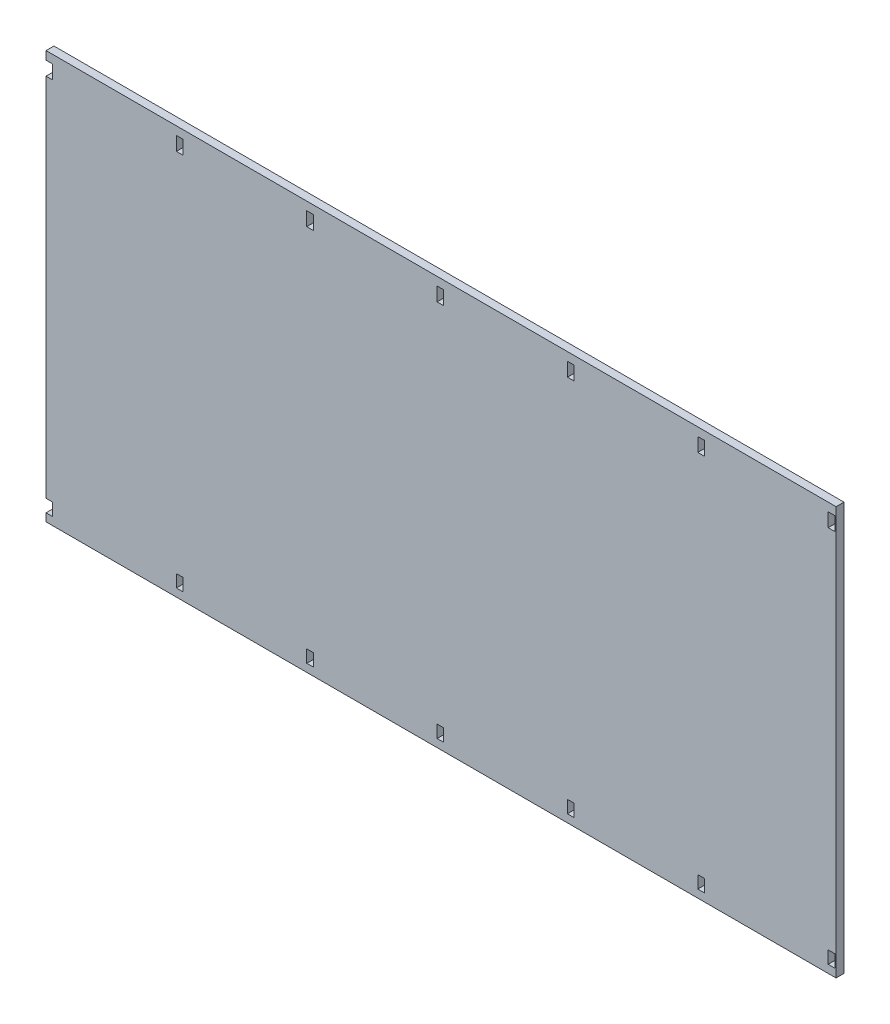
ISO-10303-21;
HEADER;
FILE_DESCRIPTION(('STEP AP214'),'2;1');
FILE_NAME('part.step','',(''),(''),'','','');
FILE_SCHEMA(('AUTOMOTIVE_DESIGN { 1 0 10303 214 1 1 1 1 }'));
ENDSEC;
DATA;
#1=APPLICATION_CONTEXT('core data for automotive mechanical design processes');
#2=APPLICATION_PROTOCOL_DEFINITION('international standard','automotive_design',2000,#1);
#3=PRODUCT_CONTEXT('',#1,'mechanical');
#4=PRODUCT('Part','Part','',(#3));
#5=PRODUCT_RELATED_PRODUCT_CATEGORY('part','',(#4));
#6=PRODUCT_DEFINITION_FORMATION('','',#4);
#7=PRODUCT_DEFINITION_CONTEXT('part definition',#1,'design');
#8=PRODUCT_DEFINITION('design','',#6,#7);
#9=PRODUCT_DEFINITION_SHAPE('','',#8);
#10=(LENGTH_UNIT() NAMED_UNIT(*) SI_UNIT(.MILLI.,.METRE.));
#11=(NAMED_UNIT(*) PLANE_ANGLE_UNIT() SI_UNIT($,.RADIAN.));
#12=(NAMED_UNIT(*) SI_UNIT($,.STERADIAN.) SOLID_ANGLE_UNIT());
#13=UNCERTAINTY_MEASURE_WITH_UNIT(LENGTH_MEASURE(1.E-05),#10,'distance_accuracy_value','');
#14=(GEOMETRIC_REPRESENTATION_CONTEXT(3) GLOBAL_UNCERTAINTY_ASSIGNED_CONTEXT((#13)) GLOBAL_UNIT_ASSIGNED_CONTEXT((#10,
#11,#12)) REPRESENTATION_CONTEXT('',''));
#15=CARTESIAN_POINT('',(0.,0.,0.));
#16=DIRECTION('',(0.,0.,1.));
#17=DIRECTION('',(1.,0.,0.));
#18=AXIS2_PLACEMENT_3D('',#15,#16,#17);
#19=CARTESIAN_POINT('',(0.,0.,3.));
#20=DIRECTION('',(0.,0.,1.));
#21=DIRECTION('',(1.,0.,0.));
#22=AXIS2_PLACEMENT_3D('',#19,#20,#21);
#23=PLANE('',#22);
#24=DIRECTION('',(0.,-1.,0.));
#25=VECTOR('',#24,1.);
#26=CARTESIAN_POINT('',(-150.,77.5,3.));
#27=LINE('',#26,#25);
#28=CARTESIAN_POINT('',(-150.,77.5,3.));
#29=VERTEX_POINT('',#28);
#30=CARTESIAN_POINT('',(-150.,74.33,3.));
#31=VERTEX_POINT('',#30);
#32=EDGE_CURVE('E943',#29,#31,#27,.T.);
#33=ORIENTED_EDGE('',*,*,#32,.T.);
#34=DIRECTION('',(1.,0.,0.));
#35=VECTOR('',#34,1.);
#36=CARTESIAN_POINT('',(-150.,74.33,3.));
#37=LINE('',#36,#35);
#38=CARTESIAN_POINT('',(-147.48,74.33,3.));
#39=VERTEX_POINT('',#38);
#40=EDGE_CURVE('E947',#31,#39,#37,.T.);
#41=ORIENTED_EDGE('',*,*,#40,.T.);
#42=DIRECTION('',(0.,-1.,0.));
#43=VECTOR('',#42,1.);
#44=CARTESIAN_POINT('',(-147.48,74.33,3.));
#45=LINE('',#44,#43);
#46=CARTESIAN_POINT('',(-147.48,69.09,3.));
#47=VERTEX_POINT('',#46);
#48=EDGE_CURVE('E951',#39,#47,#45,.T.);
#49=ORIENTED_EDGE('',*,*,#48,.T.);
#50=DIRECTION('',(-1.,0.,0.));
#51=VECTOR('',#50,1.);
#52=CARTESIAN_POINT('',(-150.,69.09,3.));
#53=LINE('',#52,#51);
#54=CARTESIAN_POINT('',(-150.,69.09,3.));
#55=VERTEX_POINT('',#54);
#56=EDGE_CURVE('E954',#47,#55,#53,.T.);
#57=ORIENTED_EDGE('',*,*,#56,.T.);
#58=DIRECTION('',(0.,-1.,0.));
#59=VECTOR('',#58,1.);
#60=CARTESIAN_POINT('',(-150.,69.09,3.));
#61=LINE('',#60,#59);
#62=CARTESIAN_POINT('',(-150.,-69.74,3.));
#63=VERTEX_POINT('',#62);
#64=EDGE_CURVE('E957',#55,#63,#61,.T.);
#65=ORIENTED_EDGE('',*,*,#64,.T.);
#66=DIRECTION('',(1.,0.,0.));
#67=VECTOR('',#66,1.);
#68=CARTESIAN_POINT('',(-150.,-69.74,3.));
#69=LINE('',#68,#67);
#70=CARTESIAN_POINT('',(-147.48,-69.74,3.));
#71=VERTEX_POINT('',#70);
#72=EDGE_CURVE('E960',#63,#71,#69,.T.);
#73=ORIENTED_EDGE('',*,*,#72,.T.);
#74=DIRECTION('',(0.,-1.,0.));
#75=VECTOR('',#74,1.);
#76=CARTESIAN_POINT('',(-147.48,-69.74,3.));
#77=LINE('',#76,#75);
#78=CARTESIAN_POINT('',(-147.48,-74.5,3.));
#79=VERTEX_POINT('',#78);
#80=EDGE_CURVE('E963',#71,#79,#77,.T.);
#81=ORIENTED_EDGE('',*,*,#80,.T.);
#82=DIRECTION('',(-1.,0.,0.));
#83=VECTOR('',#82,1.);
#84=CARTESIAN_POINT('',(-150.,-74.5,3.));
#85=LINE('',#84,#83);
#86=CARTESIAN_POINT('',(-150.,-74.5,3.));
#87=VERTEX_POINT('',#86);
#88=EDGE_CURVE('E966',#79,#87,#85,.T.);
#89=ORIENTED_EDGE('',*,*,#88,.T.);
#90=DIRECTION('',(0.,-1.,0.));
#91=VECTOR('',#90,1.);
#92=CARTESIAN_POINT('',(-150.,-74.5,3.));
#93=LINE('',#92,#91);
#94=CARTESIAN_POINT('',(-150.,-77.5,3.));
#95=VERTEX_POINT('',#94);
#96=EDGE_CURVE('E969',#87,#95,#93,.T.);
#97=ORIENTED_EDGE('',*,*,#96,.T.);
#98=DIRECTION('',(1.,0.,0.));
#99=VECTOR('',#98,1.);
#100=CARTESIAN_POINT('',(-150.,-77.5,3.));
#101=LINE('',#100,#99);
#102=CARTESIAN_POINT('',(150.,-77.5,3.));
#103=VERTEX_POINT('',#102);
#104=EDGE_CURVE('E972',#95,#103,#101,.T.);
#105=ORIENTED_EDGE('',*,*,#104,.T.);
#106=DIRECTION('',(0.,1.,0.));
#107=VECTOR('',#106,1.);
#108=CARTESIAN_POINT('',(150.,77.5,3.));
#109=LINE('',#108,#107);
#110=CARTESIAN_POINT('',(150.,77.5,3.));
#111=VERTEX_POINT('',#110);
#112=EDGE_CURVE('E975',#103,#111,#109,.T.);
#113=ORIENTED_EDGE('',*,*,#112,.T.);
#114=DIRECTION('',(-1.,0.,0.));
#115=VECTOR('',#114,1.);
#116=CARTESIAN_POINT('',(-150.,77.5,3.));
#117=LINE('',#116,#115);
#118=EDGE_CURVE('E978',#111,#29,#117,.T.);
#119=ORIENTED_EDGE('',*,*,#118,.T.);
#120=EDGE_LOOP('',(#33,#41,#49,#57,#65,#73,#81,#89,#97,#105,#113,#119));
#121=FACE_BOUND('',#120,.T.);
#122=DIRECTION('',(0.,-1.,0.));
#123=VECTOR('',#122,1.);
#124=CARTESIAN_POINT('',(-100.5,74.33,3.));
#125=LINE('',#124,#123);
#126=CARTESIAN_POINT('',(-100.5,74.33,3.));
#127=VERTEX_POINT('',#126);
#128=CARTESIAN_POINT('',(-100.5,69.09,3.));
#129=VERTEX_POINT('',#128);
#130=EDGE_CURVE('E903',#127,#129,#125,.T.);
#131=ORIENTED_EDGE('',*,*,#130,.F.);
#132=DIRECTION('',(-1.,0.,0.));
#133=VECTOR('',#132,1.);
#134=CARTESIAN_POINT('',(-100.5,74.33,3.));
#135=LINE('',#134,#133);
#136=CARTESIAN_POINT('',(-97.98,74.33,3.));
#137=VERTEX_POINT('',#136);
#138=EDGE_CURVE('E900',#137,#127,#135,.T.);
#139=ORIENTED_EDGE('',*,*,#138,.F.);
#140=DIRECTION('',(0.,1.,0.));
#141=VECTOR('',#140,1.);
#142=CARTESIAN_POINT('',(-97.98,74.33,3.));
#143=LINE('',#142,#141);
#144=CARTESIAN_POINT('',(-97.98,69.09,3.));
#145=VERTEX_POINT('',#144);
#146=EDGE_CURVE('E911',#145,#137,#143,.T.);
#147=ORIENTED_EDGE('',*,*,#146,.F.);
#148=DIRECTION('',(1.,0.,0.));
#149=VECTOR('',#148,1.);
#150=CARTESIAN_POINT('',(-100.5,69.09,3.));
#151=LINE('',#150,#149);
#152=EDGE_CURVE('E907',#129,#145,#151,.T.);
#153=ORIENTED_EDGE('',*,*,#152,.F.);
#154=EDGE_LOOP('',(#131,#139,#147,#153));
#155=FACE_BOUND('',#154,.T.);
#156=DIRECTION('',(0.,-1.,0.));
#157=VECTOR('',#156,1.);
#158=CARTESIAN_POINT('',(-51.,74.33,3.));
#159=LINE('',#158,#157);
#160=CARTESIAN_POINT('',(-51.,74.33,3.));
#161=VERTEX_POINT('',#160);
#162=CARTESIAN_POINT('',(-51.,69.09,3.));
#163=VERTEX_POINT('',#162);
#164=EDGE_CURVE('E860',#161,#163,#159,.T.);
#165=ORIENTED_EDGE('',*,*,#164,.F.);
#166=DIRECTION('',(-1.,0.,0.));
#167=VECTOR('',#166,1.);
#168=CARTESIAN_POINT('',(-51.,74.33,3.));
#169=LINE('',#168,#167);
#170=CARTESIAN_POINT('',(-48.48,74.33,3.));
#171=VERTEX_POINT('',#170);
#172=EDGE_CURVE('E857',#171,#161,#169,.T.);
#173=ORIENTED_EDGE('',*,*,#172,.F.);
#174=DIRECTION('',(0.,1.,0.));
#175=VECTOR('',#174,1.);
#176=CARTESIAN_POINT('',(-48.48,74.33,3.));
#177=LINE('',#176,#175);
#178=CARTESIAN_POINT('',(-48.48,69.09,3.));
#179=VERTEX_POINT('',#178);
#180=EDGE_CURVE('E868',#179,#171,#177,.T.);
#181=ORIENTED_EDGE('',*,*,#180,.F.);
#182=DIRECTION('',(1.,0.,0.));
#183=VECTOR('',#182,1.);
#184=CARTESIAN_POINT('',(-51.,69.09,3.));
#185=LINE('',#184,#183);
#186=EDGE_CURVE('E864',#163,#179,#185,.T.);
#187=ORIENTED_EDGE('',*,*,#186,.F.);
#188=EDGE_LOOP('',(#165,#173,#181,#187));
#189=FACE_BOUND('',#188,.T.);
#190=DIRECTION('',(0.,-1.,0.));
#191=VECTOR('',#190,1.);
#192=CARTESIAN_POINT('',(-1.49999999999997,74.33,3.));
#193=LINE('',#192,#191);
#194=CARTESIAN_POINT('',(-1.49999999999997,74.33,3.));
#195=VERTEX_POINT('',#194);
#196=CARTESIAN_POINT('',(-1.49999999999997,69.09,3.));
#197=VERTEX_POINT('',#196);
#198=EDGE_CURVE('E817',#195,#197,#193,.T.);
#199=ORIENTED_EDGE('',*,*,#198,.F.);
#200=DIRECTION('',(-1.,0.,0.));
#201=VECTOR('',#200,1.);
#202=CARTESIAN_POINT('',(-1.49999999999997,74.33,3.));
#203=LINE('',#202,#201);
#204=CARTESIAN_POINT('',(1.02000000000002,74.33,3.));
#205=VERTEX_POINT('',#204);
#206=EDGE_CURVE('E814',#205,#195,#203,.T.);
#207=ORIENTED_EDGE('',*,*,#206,.F.);
#208=DIRECTION('',(0.,1.,0.));
#209=VECTOR('',#208,1.);
#210=CARTESIAN_POINT('',(1.02000000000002,74.33,3.));
#211=LINE('',#210,#209);
#212=CARTESIAN_POINT('',(1.02000000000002,69.09,3.));
#213=VERTEX_POINT('',#212);
#214=EDGE_CURVE('E825',#213,#205,#211,.T.);
#215=ORIENTED_EDGE('',*,*,#214,.F.);
#216=DIRECTION('',(1.,0.,0.));
#217=VECTOR('',#216,1.);
#218=CARTESIAN_POINT('',(-1.49999999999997,69.09,3.));
#219=LINE('',#218,#217);
#220=EDGE_CURVE('E821',#197,#213,#219,.T.);
#221=ORIENTED_EDGE('',*,*,#220,.F.);
#222=EDGE_LOOP('',(#199,#207,#215,#221));
#223=FACE_BOUND('',#222,.T.);
#224=DIRECTION('',(0.,-1.,0.));
#225=VECTOR('',#224,1.);
#226=CARTESIAN_POINT('',(48.,74.33,3.));
#227=LINE('',#226,#225);
#228=CARTESIAN_POINT('',(48.,74.33,3.));
#229=VERTEX_POINT('',#228);
#230=CARTESIAN_POINT('',(48.,69.09,3.));
#231=VERTEX_POINT('',#230);
#232=EDGE_CURVE('E774',#229,#231,#227,.T.);
#233=ORIENTED_EDGE('',*,*,#232,.F.);
#234=DIRECTION('',(-1.,0.,0.));
#235=VECTOR('',#234,1.);
#236=CARTESIAN_POINT('',(48.,74.33,3.));
#237=LINE('',#236,#235);
#238=CARTESIAN_POINT('',(50.52,74.33,3.));
#239=VERTEX_POINT('',#238);
#240=EDGE_CURVE('E771',#239,#229,#237,.T.);
#241=ORIENTED_EDGE('',*,*,#240,.F.);
#242=DIRECTION('',(0.,1.,0.));
#243=VECTOR('',#242,1.);
#244=CARTESIAN_POINT('',(50.52,74.33,3.));
#245=LINE('',#244,#243);
#246=CARTESIAN_POINT('',(50.52,69.09,3.));
#247=VERTEX_POINT('',#246);
#248=EDGE_CURVE('E782',#247,#239,#245,.T.);
#249=ORIENTED_EDGE('',*,*,#248,.F.);
#250=DIRECTION('',(1.,0.,0.));
#251=VECTOR('',#250,1.);
#252=CARTESIAN_POINT('',(48.,69.09,3.));
#253=LINE('',#252,#251);
#254=EDGE_CURVE('E778',#231,#247,#253,.T.);
#255=ORIENTED_EDGE('',*,*,#254,.F.);
#256=EDGE_LOOP('',(#233,#241,#249,#255));
#257=FACE_BOUND('',#256,.T.);
#258=DIRECTION('',(0.,-1.,0.));
#259=VECTOR('',#258,1.);
#260=CARTESIAN_POINT('',(97.5,74.33,3.));
#261=LINE('',#260,#259);
#262=CARTESIAN_POINT('',(97.5,74.33,3.));
#263=VERTEX_POINT('',#262);
#264=CARTESIAN_POINT('',(97.5,69.09,3.));
#265=VERTEX_POINT('',#264);
#266=EDGE_CURVE('E731',#263,#265,#261,.T.);
#267=ORIENTED_EDGE('',*,*,#266,.F.);
#268=DIRECTION('',(-1.,0.,0.));
#269=VECTOR('',#268,1.);
#270=CARTESIAN_POINT('',(97.5,74.33,3.));
#271=LINE('',#270,#269);
#272=CARTESIAN_POINT('',(100.02,74.33,3.));
#273=VERTEX_POINT('',#272);
#274=EDGE_CURVE('E728',#273,#263,#271,.T.);
#275=ORIENTED_EDGE('',*,*,#274,.F.);
#276=DIRECTION('',(0.,1.,0.));
#277=VECTOR('',#276,1.);
#278=CARTESIAN_POINT('',(100.02,74.33,3.));
#279=LINE('',#278,#277);
#280=CARTESIAN_POINT('',(100.02,69.09,3.));
#281=VERTEX_POINT('',#280);
#282=EDGE_CURVE('E739',#281,#273,#279,.T.);
#283=ORIENTED_EDGE('',*,*,#282,.F.);
#284=DIRECTION('',(1.,0.,0.));
#285=VECTOR('',#284,1.);
#286=CARTESIAN_POINT('',(97.5,69.09,3.));
#287=LINE('',#286,#285);
#288=EDGE_CURVE('E735',#265,#281,#287,.T.);
#289=ORIENTED_EDGE('',*,*,#288,.F.);
#290=EDGE_LOOP('',(#267,#275,#283,#289));
#291=FACE_BOUND('',#290,.T.);
#292=DIRECTION('',(0.,-1.,0.));
#293=VECTOR('',#292,1.);
#294=CARTESIAN_POINT('',(147.,74.33,3.));
#295=LINE('',#294,#293);
#296=CARTESIAN_POINT('',(147.,74.33,3.));
#297=VERTEX_POINT('',#296);
#298=CARTESIAN_POINT('',(147.,69.09,3.));
#299=VERTEX_POINT('',#298);
#300=EDGE_CURVE('E688',#297,#299,#295,.T.);
#301=ORIENTED_EDGE('',*,*,#300,.F.);
#302=DIRECTION('',(-1.,0.,0.));
#303=VECTOR('',#302,1.);
#304=CARTESIAN_POINT('',(147.,74.33,3.));
#305=LINE('',#304,#303);
#306=CARTESIAN_POINT('',(149.52,74.33,3.));
#307=VERTEX_POINT('',#306);
#308=EDGE_CURVE('E685',#307,#297,#305,.T.);
#309=ORIENTED_EDGE('',*,*,#308,.F.);
#310=DIRECTION('',(0.,1.,0.));
#311=VECTOR('',#310,1.);
#312=CARTESIAN_POINT('',(149.52,74.33,3.));
#313=LINE('',#312,#311);
#314=CARTESIAN_POINT('',(149.52,69.09,3.));
#315=VERTEX_POINT('',#314);
#316=EDGE_CURVE('E696',#315,#307,#313,.T.);
#317=ORIENTED_EDGE('',*,*,#316,.F.);
#318=DIRECTION('',(1.,0.,0.));
#319=VECTOR('',#318,1.);
#320=CARTESIAN_POINT('',(147.,69.09,3.));
#321=LINE('',#320,#319);
#322=EDGE_CURVE('E692',#299,#315,#321,.T.);
#323=ORIENTED_EDGE('',*,*,#322,.F.);
#324=EDGE_LOOP('',(#301,#309,#317,#323));
#325=FACE_BOUND('',#324,.T.);
#326=DIRECTION('',(0.,-1.,0.));
#327=VECTOR('',#326,1.);
#328=CARTESIAN_POINT('',(-100.5,-69.74,3.));
#329=LINE('',#328,#327);
#330=CARTESIAN_POINT('',(-100.5,-69.74,3.));
#331=VERTEX_POINT('',#330);
#332=CARTESIAN_POINT('',(-100.5,-74.5,3.));
#333=VERTEX_POINT('',#332);
#334=EDGE_CURVE('E645',#331,#333,#329,.T.);
#335=ORIENTED_EDGE('',*,*,#334,.F.);
#336=DIRECTION('',(-1.,0.,0.));
#337=VECTOR('',#336,1.);
#338=CARTESIAN_POINT('',(-100.5,-69.74,3.));
#339=LINE('',#338,#337);
#340=CARTESIAN_POINT('',(-97.98,-69.74,3.));
#341=VERTEX_POINT('',#340);
#342=EDGE_CURVE('E642',#341,#331,#339,.T.);
#343=ORIENTED_EDGE('',*,*,#342,.F.);
#344=DIRECTION('',(0.,1.,0.));
#345=VECTOR('',#344,1.);
#346=CARTESIAN_POINT('',(-97.98,-69.74,3.));
#347=LINE('',#346,#345);
#348=CARTESIAN_POINT('',(-97.98,-74.5,3.));
#349=VERTEX_POINT('',#348);
#350=EDGE_CURVE('E653',#349,#341,#347,.T.);
#351=ORIENTED_EDGE('',*,*,#350,.F.);
#352=DIRECTION('',(1.,0.,0.));
#353=VECTOR('',#352,1.);
#354=CARTESIAN_POINT('',(-100.5,-74.5,3.));
#355=LINE('',#354,#353);
#356=EDGE_CURVE('E649',#333,#349,#355,.T.);
#357=ORIENTED_EDGE('',*,*,#356,.F.);
#358=EDGE_LOOP('',(#335,#343,#351,#357));
#359=FACE_BOUND('',#358,.T.);
#360=DIRECTION('',(0.,-1.,0.));
#361=VECTOR('',#360,1.);
#362=CARTESIAN_POINT('',(-51.,-69.74,3.));
#363=LINE('',#362,#361);
#364=CARTESIAN_POINT('',(-51.,-69.74,3.));
#365=VERTEX_POINT('',#364);
#366=CARTESIAN_POINT('',(-51.,-74.5,3.));
#367=VERTEX_POINT('',#366);
#368=EDGE_CURVE('E602',#365,#367,#363,.T.);
#369=ORIENTED_EDGE('',*,*,#368,.F.);
#370=DIRECTION('',(-1.,0.,0.));
#371=VECTOR('',#370,1.);
#372=CARTESIAN_POINT('',(-51.,-69.74,3.));
#373=LINE('',#372,#371);
#374=CARTESIAN_POINT('',(-48.48,-69.74,3.));
#375=VERTEX_POINT('',#374);
#376=EDGE_CURVE('E599',#375,#365,#373,.T.);
#377=ORIENTED_EDGE('',*,*,#376,.F.);
#378=DIRECTION('',(0.,1.,0.));
#379=VECTOR('',#378,1.);
#380=CARTESIAN_POINT('',(-48.48,-69.74,3.));
#381=LINE('',#380,#379);
#382=CARTESIAN_POINT('',(-48.48,-74.5,3.));
#383=VERTEX_POINT('',#382);
#384=EDGE_CURVE('E610',#383,#375,#381,.T.);
#385=ORIENTED_EDGE('',*,*,#384,.F.);
#386=DIRECTION('',(1.,0.,0.));
#387=VECTOR('',#386,1.);
#388=CARTESIAN_POINT('',(-51.,-74.5,3.));
#389=LINE('',#388,#387);
#390=EDGE_CURVE('E606',#367,#383,#389,.T.);
#391=ORIENTED_EDGE('',*,*,#390,.F.);
#392=EDGE_LOOP('',(#369,#377,#385,#391));
#393=FACE_BOUND('',#392,.T.);
#394=DIRECTION('',(0.,-1.,0.));
#395=VECTOR('',#394,1.);
#396=CARTESIAN_POINT('',(-1.49999999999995,-69.74,3.));
#397=LINE('',#396,#395);
#398=CARTESIAN_POINT('',(-1.49999999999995,-69.74,3.));
#399=VERTEX_POINT('',#398);
#400=CARTESIAN_POINT('',(-1.49999999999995,-74.5,3.));
#401=VERTEX_POINT('',#400);
#402=EDGE_CURVE('E559',#399,#401,#397,.T.);
#403=ORIENTED_EDGE('',*,*,#402,.F.);
#404=DIRECTION('',(-1.,0.,0.));
#405=VECTOR('',#404,1.);
#406=CARTESIAN_POINT('',(-1.49999999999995,-69.74,3.));
#407=LINE('',#406,#405);
#408=CARTESIAN_POINT('',(1.02000000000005,-69.74,3.));
#409=VERTEX_POINT('',#408);
#410=EDGE_CURVE('E556',#409,#399,#407,.T.);
#411=ORIENTED_EDGE('',*,*,#410,.F.);
#412=DIRECTION('',(0.,1.,0.));
#413=VECTOR('',#412,1.);
#414=CARTESIAN_POINT('',(1.02000000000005,-69.74,3.));
#415=LINE('',#414,#413);
#416=CARTESIAN_POINT('',(1.02000000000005,-74.5,3.));
#417=VERTEX_POINT('',#416);
#418=EDGE_CURVE('E567',#417,#409,#415,.T.);
#419=ORIENTED_EDGE('',*,*,#418,.F.);
#420=DIRECTION('',(1.,0.,0.));
#421=VECTOR('',#420,1.);
#422=CARTESIAN_POINT('',(-1.49999999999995,-74.5,3.));
#423=LINE('',#422,#421);
#424=EDGE_CURVE('E563',#401,#417,#423,.T.);
#425=ORIENTED_EDGE('',*,*,#424,.F.);
#426=EDGE_LOOP('',(#403,#411,#419,#425));
#427=FACE_BOUND('',#426,.T.);
#428=DIRECTION('',(0.,-1.,0.));
#429=VECTOR('',#428,1.);
#430=CARTESIAN_POINT('',(48.,-69.74,3.));
#431=LINE('',#430,#429);
#432=CARTESIAN_POINT('',(48.,-69.74,3.));
#433=VERTEX_POINT('',#432);
#434=CARTESIAN_POINT('',(48.,-74.5,3.));
#435=VERTEX_POINT('',#434);
#436=EDGE_CURVE('E516',#433,#435,#431,.T.);
#437=ORIENTED_EDGE('',*,*,#436,.F.);
#438=DIRECTION('',(-1.,0.,0.));
#439=VECTOR('',#438,1.);
#440=CARTESIAN_POINT('',(48.,-69.74,3.));
#441=LINE('',#440,#439);
#442=CARTESIAN_POINT('',(50.52,-69.74,3.));
#443=VERTEX_POINT('',#442);
#444=EDGE_CURVE('E513',#443,#433,#441,.T.);
#445=ORIENTED_EDGE('',*,*,#444,.F.);
#446=DIRECTION('',(0.,1.,0.));
#447=VECTOR('',#446,1.);
#448=CARTESIAN_POINT('',(50.52,-69.74,3.));
#449=LINE('',#448,#447);
#450=CARTESIAN_POINT('',(50.52,-74.5,3.));
#451=VERTEX_POINT('',#450);
#452=EDGE_CURVE('E524',#451,#443,#449,.T.);
#453=ORIENTED_EDGE('',*,*,#452,.F.);
#454=DIRECTION('',(1.,0.,0.));
#455=VECTOR('',#454,1.);
#456=CARTESIAN_POINT('',(48.,-74.5,3.));
#457=LINE('',#456,#455);
#458=EDGE_CURVE('E520',#435,#451,#457,.T.);
#459=ORIENTED_EDGE('',*,*,#458,.F.);
#460=EDGE_LOOP('',(#437,#445,#453,#459));
#461=FACE_BOUND('',#460,.T.);
#462=DIRECTION('',(0.,-1.,0.));
#463=VECTOR('',#462,1.);
#464=CARTESIAN_POINT('',(97.5,-69.74,3.));
#465=LINE('',#464,#463);
#466=CARTESIAN_POINT('',(97.5,-69.74,3.));
#467=VERTEX_POINT('',#466);
#468=CARTESIAN_POINT('',(97.5,-74.5,3.));
#469=VERTEX_POINT('',#468);
#470=EDGE_CURVE('E473',#467,#469,#465,.T.);
#471=ORIENTED_EDGE('',*,*,#470,.F.);
#472=DIRECTION('',(-1.,0.,0.));
#473=VECTOR('',#472,1.);
#474=CARTESIAN_POINT('',(97.5,-69.74,3.));
#475=LINE('',#474,#473);
#476=CARTESIAN_POINT('',(100.02,-69.74,3.));
#477=VERTEX_POINT('',#476);
#478=EDGE_CURVE('E470',#477,#467,#475,.T.);
#479=ORIENTED_EDGE('',*,*,#478,.F.);
#480=DIRECTION('',(0.,1.,0.));
#481=VECTOR('',#480,1.);
#482=CARTESIAN_POINT('',(100.02,-69.74,3.));
#483=LINE('',#482,#481);
#484=CARTESIAN_POINT('',(100.02,-74.5,3.));
#485=VERTEX_POINT('',#484);
#486=EDGE_CURVE('E481',#485,#477,#483,.T.);
#487=ORIENTED_EDGE('',*,*,#486,.F.);
#488=DIRECTION('',(1.,0.,0.));
#489=VECTOR('',#488,1.);
#490=CARTESIAN_POINT('',(97.5,-74.5,3.));
#491=LINE('',#490,#489);
#492=EDGE_CURVE('E477',#469,#485,#491,.T.);
#493=ORIENTED_EDGE('',*,*,#492,.F.);
#494=EDGE_LOOP('',(#471,#479,#487,#493));
#495=FACE_BOUND('',#494,.T.);
#496=DIRECTION('',(0.,-1.,0.));
#497=VECTOR('',#496,1.);
#498=CARTESIAN_POINT('',(147.,-69.74,3.));
#499=LINE('',#498,#497);
#500=CARTESIAN_POINT('',(147.,-69.74,3.));
#501=VERTEX_POINT('',#500);
#502=CARTESIAN_POINT('',(147.,-74.5,3.));
#503=VERTEX_POINT('',#502);
#504=EDGE_CURVE('E431',#501,#503,#499,.T.);
#505=ORIENTED_EDGE('',*,*,#504,.F.);
#506=DIRECTION('',(-1.,0.,0.));
#507=VECTOR('',#506,1.);
#508=CARTESIAN_POINT('',(147.,-69.74,3.));
#509=LINE('',#508,#507);
#510=CARTESIAN_POINT('',(149.52,-69.74,3.));
#511=VERTEX_POINT('',#510);
#512=EDGE_CURVE('E422',#511,#501,#509,.T.);
#513=ORIENTED_EDGE('',*,*,#512,.F.);
#514=DIRECTION('',(0.,1.,0.));
#515=VECTOR('',#514,1.);
#516=CARTESIAN_POINT('',(149.52,-69.74,3.));
#517=LINE('',#516,#515);
#518=CARTESIAN_POINT('',(149.52,-74.5,3.));
#519=VERTEX_POINT('',#518);
#520=EDGE_CURVE('E448',#519,#511,#517,.T.);
#521=ORIENTED_EDGE('',*,*,#520,.F.);
#522=DIRECTION('',(1.,0.,0.));
#523=VECTOR('',#522,1.);
#524=CARTESIAN_POINT('',(147.,-74.5,3.));
#525=LINE('',#524,#523);
#526=EDGE_CURVE('E444',#503,#519,#525,.T.);
#527=ORIENTED_EDGE('',*,*,#526,.F.);
#528=EDGE_LOOP('',(#505,#513,#521,#527));
#529=FACE_BOUND('',#528,.T.);
#530=ADVANCED_FACE('F44',(#121,#155,#189,#223,#257,#291,#325,#359,#393,#427,#461,#495,#529),#23,.T.);
#531=CARTESIAN_POINT('',(0.,0.,0.));
#532=DIRECTION('',(0.,0.,1.));
#533=DIRECTION('',(1.,0.,0.));
#534=AXIS2_PLACEMENT_3D('',#531,#532,#533);
#535=PLANE('',#534);
#536=DIRECTION('',(-1.,0.,0.));
#537=VECTOR('',#536,1.);
#538=CARTESIAN_POINT('',(97.5,-69.74,0.));
#539=LINE('',#538,#537);
#540=CARTESIAN_POINT('',(100.02,-69.74,0.));
#541=VERTEX_POINT('',#540);
#542=CARTESIAN_POINT('',(97.5,-69.74,0.));
#543=VERTEX_POINT('',#542);
#544=EDGE_CURVE('E440',#541,#543,#539,.T.);
#545=ORIENTED_EDGE('',*,*,#544,.T.);
#546=DIRECTION('',(0.,-1.,0.));
#547=VECTOR('',#546,1.);
#548=CARTESIAN_POINT('',(97.5,-69.74,0.));
#549=LINE('',#548,#547);
#550=CARTESIAN_POINT('',(97.5,-74.5,0.));
#551=VERTEX_POINT('',#550);
#552=EDGE_CURVE('E488',#543,#551,#549,.T.);
#553=ORIENTED_EDGE('',*,*,#552,.T.);
#554=DIRECTION('',(1.,0.,0.));
#555=VECTOR('',#554,1.);
#556=CARTESIAN_POINT('',(97.5,-74.5,0.));
#557=LINE('',#556,#555);
#558=CARTESIAN_POINT('',(100.02,-74.5,0.));
#559=VERTEX_POINT('',#558);
#560=EDGE_CURVE('E492',#551,#559,#557,.T.);
#561=ORIENTED_EDGE('',*,*,#560,.T.);
#562=DIRECTION('',(0.,1.,0.));
#563=VECTOR('',#562,1.);
#564=CARTESIAN_POINT('',(100.02,-69.74,0.));
#565=LINE('',#564,#563);
#566=EDGE_CURVE('E474',#559,#541,#565,.T.);
#567=ORIENTED_EDGE('',*,*,#566,.T.);
#568=EDGE_LOOP('',(#545,#553,#561,#567));
#569=FACE_BOUND('',#568,.T.);
#570=DIRECTION('',(-1.,0.,0.));
#571=VECTOR('',#570,1.);
#572=CARTESIAN_POINT('',(-1.49999999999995,-69.74,0.));
#573=LINE('',#572,#571);
#574=CARTESIAN_POINT('',(1.02000000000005,-69.74,0.));
#575=VERTEX_POINT('',#574);
#576=CARTESIAN_POINT('',(-1.49999999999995,-69.74,0.));
#577=VERTEX_POINT('',#576);
#578=EDGE_CURVE('E555',#575,#577,#573,.T.);
#579=ORIENTED_EDGE('',*,*,#578,.T.);
#580=DIRECTION('',(0.,-1.,0.));
#581=VECTOR('',#580,1.);
#582=CARTESIAN_POINT('',(-1.49999999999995,-69.74,0.));
#583=LINE('',#582,#581);
#584=CARTESIAN_POINT('',(-1.49999999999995,-74.5,0.));
#585=VERTEX_POINT('',#584);
#586=EDGE_CURVE('E574',#577,#585,#583,.T.);
#587=ORIENTED_EDGE('',*,*,#586,.T.);
#588=DIRECTION('',(1.,0.,0.));
#589=VECTOR('',#588,1.);
#590=CARTESIAN_POINT('',(-1.49999999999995,-74.5,0.));
#591=LINE('',#590,#589);
#592=CARTESIAN_POINT('',(1.02000000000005,-74.5,0.));
#593=VERTEX_POINT('',#592);
#594=EDGE_CURVE('E578',#585,#593,#591,.T.);
#595=ORIENTED_EDGE('',*,*,#594,.T.);
#596=DIRECTION('',(0.,1.,0.));
#597=VECTOR('',#596,1.);
#598=CARTESIAN_POINT('',(1.02000000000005,-69.74,0.));
#599=LINE('',#598,#597);
#600=EDGE_CURVE('E560',#593,#575,#599,.T.);
#601=ORIENTED_EDGE('',*,*,#600,.T.);
#602=EDGE_LOOP('',(#579,#587,#595,#601));
#603=FACE_BOUND('',#602,.T.);
#604=DIRECTION('',(-1.,0.,0.));
#605=VECTOR('',#604,1.);
#606=CARTESIAN_POINT('',(-100.5,-69.74,0.));
#607=LINE('',#606,#605);
#608=CARTESIAN_POINT('',(-97.98,-69.74,0.));
#609=VERTEX_POINT('',#608);
#610=CARTESIAN_POINT('',(-100.5,-69.74,0.));
#611=VERTEX_POINT('',#610);
#612=EDGE_CURVE('E641',#609,#611,#607,.T.);
#613=ORIENTED_EDGE('',*,*,#612,.T.);
#614=DIRECTION('',(0.,-1.,0.));
#615=VECTOR('',#614,1.);
#616=CARTESIAN_POINT('',(-100.5,-69.74,0.));
#617=LINE('',#616,#615);
#618=CARTESIAN_POINT('',(-100.5,-74.5,0.));
#619=VERTEX_POINT('',#618);
#620=EDGE_CURVE('E660',#611,#619,#617,.T.);
#621=ORIENTED_EDGE('',*,*,#620,.T.);
#622=DIRECTION('',(1.,0.,0.));
#623=VECTOR('',#622,1.);
#624=CARTESIAN_POINT('',(-100.5,-74.5,0.));
#625=LINE('',#624,#623);
#626=CARTESIAN_POINT('',(-97.98,-74.5,0.));
#627=VERTEX_POINT('',#626);
#628=EDGE_CURVE('E664',#619,#627,#625,.T.);
#629=ORIENTED_EDGE('',*,*,#628,.T.);
#630=DIRECTION('',(0.,1.,0.));
#631=VECTOR('',#630,1.);
#632=CARTESIAN_POINT('',(-97.98,-69.74,0.));
#633=LINE('',#632,#631);
#634=EDGE_CURVE('E646',#627,#609,#633,.T.);
#635=ORIENTED_EDGE('',*,*,#634,.T.);
#636=EDGE_LOOP('',(#613,#621,#629,#635));
#637=FACE_BOUND('',#636,.T.);
#638=DIRECTION('',(-1.,0.,0.));
#639=VECTOR('',#638,1.);
#640=CARTESIAN_POINT('',(97.5,74.33,0.));
#641=LINE('',#640,#639);
#642=CARTESIAN_POINT('',(100.02,74.33,0.));
#643=VERTEX_POINT('',#642);
#644=CARTESIAN_POINT('',(97.5,74.33,0.));
#645=VERTEX_POINT('',#644);
#646=EDGE_CURVE('E727',#643,#645,#641,.T.);
#647=ORIENTED_EDGE('',*,*,#646,.T.);
#648=DIRECTION('',(0.,-1.,0.));
#649=VECTOR('',#648,1.);
#650=CARTESIAN_POINT('',(97.5,74.33,0.));
#651=LINE('',#650,#649);
#652=CARTESIAN_POINT('',(97.5,69.09,0.));
#653=VERTEX_POINT('',#652);
#654=EDGE_CURVE('E746',#645,#653,#651,.T.);
#655=ORIENTED_EDGE('',*,*,#654,.T.);
#656=DIRECTION('',(1.,0.,0.));
#657=VECTOR('',#656,1.);
#658=CARTESIAN_POINT('',(97.5,69.09,0.));
#659=LINE('',#658,#657);
#660=CARTESIAN_POINT('',(100.02,69.09,0.));
#661=VERTEX_POINT('',#660);
#662=EDGE_CURVE('E750',#653,#661,#659,.T.);
#663=ORIENTED_EDGE('',*,*,#662,.T.);
#664=DIRECTION('',(0.,1.,0.));
#665=VECTOR('',#664,1.);
#666=CARTESIAN_POINT('',(100.02,74.33,0.));
#667=LINE('',#666,#665);
#668=EDGE_CURVE('E732',#661,#643,#667,.T.);
#669=ORIENTED_EDGE('',*,*,#668,.T.);
#670=EDGE_LOOP('',(#647,#655,#663,#669));
#671=FACE_BOUND('',#670,.T.);
#672=DIRECTION('',(-1.,0.,0.));
#673=VECTOR('',#672,1.);
#674=CARTESIAN_POINT('',(-1.49999999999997,74.33,0.));
#675=LINE('',#674,#673);
#676=CARTESIAN_POINT('',(1.02000000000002,74.33,0.));
#677=VERTEX_POINT('',#676);
#678=CARTESIAN_POINT('',(-1.49999999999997,74.33,0.));
#679=VERTEX_POINT('',#678);
#680=EDGE_CURVE('E813',#677,#679,#675,.T.);
#681=ORIENTED_EDGE('',*,*,#680,.T.);
#682=DIRECTION('',(0.,-1.,0.));
#683=VECTOR('',#682,1.);
#684=CARTESIAN_POINT('',(-1.49999999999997,74.33,0.));
#685=LINE('',#684,#683);
#686=CARTESIAN_POINT('',(-1.49999999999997,69.09,0.));
#687=VERTEX_POINT('',#686);
#688=EDGE_CURVE('E832',#679,#687,#685,.T.);
#689=ORIENTED_EDGE('',*,*,#688,.T.);
#690=DIRECTION('',(1.,0.,0.));
#691=VECTOR('',#690,1.);
#692=CARTESIAN_POINT('',(-1.49999999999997,69.09,0.));
#693=LINE('',#692,#691);
#694=CARTESIAN_POINT('',(1.02000000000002,69.09,0.));
#695=VERTEX_POINT('',#694);
#696=EDGE_CURVE('E836',#687,#695,#693,.T.);
#697=ORIENTED_EDGE('',*,*,#696,.T.);
#698=DIRECTION('',(0.,1.,0.));
#699=VECTOR('',#698,1.);
#700=CARTESIAN_POINT('',(1.02000000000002,74.33,0.));
#701=LINE('',#700,#699);
#702=EDGE_CURVE('E818',#695,#677,#701,.T.);
#703=ORIENTED_EDGE('',*,*,#702,.T.);
#704=EDGE_LOOP('',(#681,#689,#697,#703));
#705=FACE_BOUND('',#704,.T.);
#706=DIRECTION('',(-1.,0.,0.));
#707=VECTOR('',#706,1.);
#708=CARTESIAN_POINT('',(-100.5,74.33,0.));
#709=LINE('',#708,#707);
#710=CARTESIAN_POINT('',(-97.98,74.33,0.));
#711=VERTEX_POINT('',#710);
#712=CARTESIAN_POINT('',(-100.5,74.33,0.));
#713=VERTEX_POINT('',#712);
#714=EDGE_CURVE('E899',#711,#713,#709,.T.);
#715=ORIENTED_EDGE('',*,*,#714,.T.);
#716=DIRECTION('',(0.,-1.,0.));
#717=VECTOR('',#716,1.);
#718=CARTESIAN_POINT('',(-100.5,74.33,0.));
#719=LINE('',#718,#717);
#720=CARTESIAN_POINT('',(-100.5,69.09,0.));
#721=VERTEX_POINT('',#720);
#722=EDGE_CURVE('E918',#713,#721,#719,.T.);
#723=ORIENTED_EDGE('',*,*,#722,.T.);
#724=DIRECTION('',(1.,0.,0.));
#725=VECTOR('',#724,1.);
#726=CARTESIAN_POINT('',(-100.5,69.09,0.));
#727=LINE('',#726,#725);
#728=CARTESIAN_POINT('',(-97.98,69.09,0.));
#729=VERTEX_POINT('',#728);
#730=EDGE_CURVE('E922',#721,#729,#727,.T.);
#731=ORIENTED_EDGE('',*,*,#730,.T.);
#732=DIRECTION('',(0.,1.,0.));
#733=VECTOR('',#732,1.);
#734=CARTESIAN_POINT('',(-97.98,74.33,0.));
#735=LINE('',#734,#733);
#736=EDGE_CURVE('E904',#729,#711,#735,.T.);
#737=ORIENTED_EDGE('',*,*,#736,.T.);
#738=EDGE_LOOP('',(#715,#723,#731,#737));
#739=FACE_BOUND('',#738,.T.);
#740=DIRECTION('',(0.,-1.,0.));
#741=VECTOR('',#740,1.);
#742=CARTESIAN_POINT('',(-150.,77.5,0.));
#743=LINE('',#742,#741);
#744=CARTESIAN_POINT('',(-150.,77.5,0.));
#745=VERTEX_POINT('',#744);
#746=CARTESIAN_POINT('',(-150.,74.33,0.));
#747=VERTEX_POINT('',#746);
#748=EDGE_CURVE('E942',#745,#747,#743,.T.);
#749=ORIENTED_EDGE('',*,*,#748,.F.);
#750=DIRECTION('',(-1.,0.,0.));
#751=VECTOR('',#750,1.);
#752=CARTESIAN_POINT('',(-150.,77.5,0.));
#753=LINE('',#752,#751);
#754=CARTESIAN_POINT('',(150.,77.5,0.));
#755=VERTEX_POINT('',#754);
#756=EDGE_CURVE('E948',#755,#745,#753,.T.);
#757=ORIENTED_EDGE('',*,*,#756,.F.);
#758=DIRECTION('',(0.,1.,0.));
#759=VECTOR('',#758,1.);
#760=CARTESIAN_POINT('',(150.,77.5,0.));
#761=LINE('',#760,#759);
#762=CARTESIAN_POINT('',(150.,-77.5,0.));
#763=VERTEX_POINT('',#762);
#764=EDGE_CURVE('E1012',#763,#755,#761,.T.);
#765=ORIENTED_EDGE('',*,*,#764,.F.);
#766=DIRECTION('',(1.,0.,0.));
#767=VECTOR('',#766,1.);
#768=CARTESIAN_POINT('',(-150.,-77.5,0.));
#769=LINE('',#768,#767);
#770=CARTESIAN_POINT('',(-150.,-77.5,0.));
#771=VERTEX_POINT('',#770);
#772=EDGE_CURVE('E1009',#771,#763,#769,.T.);
#773=ORIENTED_EDGE('',*,*,#772,.F.);
#774=DIRECTION('',(0.,-1.,0.));
#775=VECTOR('',#774,1.);
#776=CARTESIAN_POINT('',(-150.,-74.5,0.));
#777=LINE('',#776,#775);
#778=CARTESIAN_POINT('',(-150.,-74.5,0.));
#779=VERTEX_POINT('',#778);
#780=EDGE_CURVE('E1006',#779,#771,#777,.T.);
#781=ORIENTED_EDGE('',*,*,#780,.F.);
#782=DIRECTION('',(-1.,0.,0.));
#783=VECTOR('',#782,1.);
#784=CARTESIAN_POINT('',(-150.,-74.5,0.));
#785=LINE('',#784,#783);
#786=CARTESIAN_POINT('',(-147.48,-74.5,0.));
#787=VERTEX_POINT('',#786);
#788=EDGE_CURVE('E1003',#787,#779,#785,.T.);
#789=ORIENTED_EDGE('',*,*,#788,.F.);
#790=DIRECTION('',(0.,-1.,0.));
#791=VECTOR('',#790,1.);
#792=CARTESIAN_POINT('',(-147.48,-69.74,0.));
#793=LINE('',#792,#791);
#794=CARTESIAN_POINT('',(-147.48,-69.74,0.));
#795=VERTEX_POINT('',#794);
#796=EDGE_CURVE('E1000',#795,#787,#793,.T.);
#797=ORIENTED_EDGE('',*,*,#796,.F.);
#798=DIRECTION('',(1.,0.,0.));
#799=VECTOR('',#798,1.);
#800=CARTESIAN_POINT('',(-150.,-69.74,0.));
#801=LINE('',#800,#799);
#802=CARTESIAN_POINT('',(-150.,-69.74,0.));
#803=VERTEX_POINT('',#802);
#804=EDGE_CURVE('E997',#803,#795,#801,.T.);
#805=ORIENTED_EDGE('',*,*,#804,.F.);
#806=DIRECTION('',(0.,-1.,0.));
#807=VECTOR('',#806,1.);
#808=CARTESIAN_POINT('',(-150.,69.09,0.));
#809=LINE('',#808,#807);
#810=CARTESIAN_POINT('',(-150.,69.09,0.));
#811=VERTEX_POINT('',#810);
#812=EDGE_CURVE('E994',#811,#803,#809,.T.);
#813=ORIENTED_EDGE('',*,*,#812,.F.);
#814=DIRECTION('',(-1.,0.,0.));
#815=VECTOR('',#814,1.);
#816=CARTESIAN_POINT('',(-150.,69.09,0.));
#817=LINE('',#816,#815);
#818=CARTESIAN_POINT('',(-147.48,69.09,0.));
#819=VERTEX_POINT('',#818);
#820=EDGE_CURVE('E991',#819,#811,#817,.T.);
#821=ORIENTED_EDGE('',*,*,#820,.F.);
#822=DIRECTION('',(0.,-1.,0.));
#823=VECTOR('',#822,1.);
#824=CARTESIAN_POINT('',(-147.48,74.33,0.));
#825=LINE('',#824,#823);
#826=CARTESIAN_POINT('',(-147.48,74.33,0.));
#827=VERTEX_POINT('',#826);
#828=EDGE_CURVE('E988',#827,#819,#825,.T.);
#829=ORIENTED_EDGE('',*,*,#828,.F.);
#830=DIRECTION('',(1.,0.,0.));
#831=VECTOR('',#830,1.);
#832=CARTESIAN_POINT('',(-150.,74.33,0.));
#833=LINE('',#832,#831);
#834=EDGE_CURVE('E985',#747,#827,#833,.T.);
#835=ORIENTED_EDGE('',*,*,#834,.F.);
#836=EDGE_LOOP('',(#749,#757,#765,#773,#781,#789,#797,#805,#813,#821,#829,#835));
#837=FACE_BOUND('',#836,.T.);
#838=DIRECTION('',(-1.,0.,0.));
#839=VECTOR('',#838,1.);
#840=CARTESIAN_POINT('',(-51.,74.33,0.));
#841=LINE('',#840,#839);
#842=CARTESIAN_POINT('',(-48.48,74.33,0.));
#843=VERTEX_POINT('',#842);
#844=CARTESIAN_POINT('',(-51.,74.33,0.));
#845=VERTEX_POINT('',#844);
#846=EDGE_CURVE('E856',#843,#845,#841,.T.);
#847=ORIENTED_EDGE('',*,*,#846,.T.);
#848=DIRECTION('',(0.,-1.,0.));
#849=VECTOR('',#848,1.);
#850=CARTESIAN_POINT('',(-51.,74.33,0.));
#851=LINE('',#850,#849);
#852=CARTESIAN_POINT('',(-51.,69.09,0.));
#853=VERTEX_POINT('',#852);
#854=EDGE_CURVE('E875',#845,#853,#851,.T.);
#855=ORIENTED_EDGE('',*,*,#854,.T.);
#856=DIRECTION('',(1.,0.,0.));
#857=VECTOR('',#856,1.);
#858=CARTESIAN_POINT('',(-51.,69.09,0.));
#859=LINE('',#858,#857);
#860=CARTESIAN_POINT('',(-48.48,69.09,0.));
#861=VERTEX_POINT('',#860);
#862=EDGE_CURVE('E879',#853,#861,#859,.T.);
#863=ORIENTED_EDGE('',*,*,#862,.T.);
#864=DIRECTION('',(0.,1.,0.));
#865=VECTOR('',#864,1.);
#866=CARTESIAN_POINT('',(-48.48,74.33,0.));
#867=LINE('',#866,#865);
#868=EDGE_CURVE('E861',#861,#843,#867,.T.);
#869=ORIENTED_EDGE('',*,*,#868,.T.);
#870=EDGE_LOOP('',(#847,#855,#863,#869));
#871=FACE_BOUND('',#870,.T.);
#872=DIRECTION('',(-1.,0.,0.));
#873=VECTOR('',#872,1.);
#874=CARTESIAN_POINT('',(48.,74.33,0.));
#875=LINE('',#874,#873);
#876=CARTESIAN_POINT('',(50.52,74.33,0.));
#877=VERTEX_POINT('',#876);
#878=CARTESIAN_POINT('',(48.,74.33,0.));
#879=VERTEX_POINT('',#878);
#880=EDGE_CURVE('E770',#877,#879,#875,.T.);
#881=ORIENTED_EDGE('',*,*,#880,.T.);
#882=DIRECTION('',(0.,-1.,0.));
#883=VECTOR('',#882,1.);
#884=CARTESIAN_POINT('',(48.,74.33,0.));
#885=LINE('',#884,#883);
#886=CARTESIAN_POINT('',(48.,69.09,0.));
#887=VERTEX_POINT('',#886);
#888=EDGE_CURVE('E789',#879,#887,#885,.T.);
#889=ORIENTED_EDGE('',*,*,#888,.T.);
#890=DIRECTION('',(1.,0.,0.));
#891=VECTOR('',#890,1.);
#892=CARTESIAN_POINT('',(48.,69.09,0.));
#893=LINE('',#892,#891);
#894=CARTESIAN_POINT('',(50.52,69.09,0.));
#895=VERTEX_POINT('',#894);
#896=EDGE_CURVE('E793',#887,#895,#893,.T.);
#897=ORIENTED_EDGE('',*,*,#896,.T.);
#898=DIRECTION('',(0.,1.,0.));
#899=VECTOR('',#898,1.);
#900=CARTESIAN_POINT('',(50.52,74.33,0.));
#901=LINE('',#900,#899);
#902=EDGE_CURVE('E775',#895,#877,#901,.T.);
#903=ORIENTED_EDGE('',*,*,#902,.T.);
#904=EDGE_LOOP('',(#881,#889,#897,#903));
#905=FACE_BOUND('',#904,.T.);
#906=DIRECTION('',(-1.,0.,0.));
#907=VECTOR('',#906,1.);
#908=CARTESIAN_POINT('',(147.,74.33,0.));
#909=LINE('',#908,#907);
#910=CARTESIAN_POINT('',(149.52,74.33,0.));
#911=VERTEX_POINT('',#910);
#912=CARTESIAN_POINT('',(147.,74.33,0.));
#913=VERTEX_POINT('',#912);
#914=EDGE_CURVE('E684',#911,#913,#909,.T.);
#915=ORIENTED_EDGE('',*,*,#914,.T.);
#916=DIRECTION('',(0.,-1.,0.));
#917=VECTOR('',#916,1.);
#918=CARTESIAN_POINT('',(147.,74.33,0.));
#919=LINE('',#918,#917);
#920=CARTESIAN_POINT('',(147.,69.09,0.));
#921=VERTEX_POINT('',#920);
#922=EDGE_CURVE('E703',#913,#921,#919,.T.);
#923=ORIENTED_EDGE('',*,*,#922,.T.);
#924=DIRECTION('',(1.,0.,0.));
#925=VECTOR('',#924,1.);
#926=CARTESIAN_POINT('',(147.,69.09,0.));
#927=LINE('',#926,#925);
#928=CARTESIAN_POINT('',(149.52,69.09,0.));
#929=VERTEX_POINT('',#928);
#930=EDGE_CURVE('E707',#921,#929,#927,.T.);
#931=ORIENTED_EDGE('',*,*,#930,.T.);
#932=DIRECTION('',(0.,1.,0.));
#933=VECTOR('',#932,1.);
#934=CARTESIAN_POINT('',(149.52,74.33,0.));
#935=LINE('',#934,#933);
#936=EDGE_CURVE('E689',#929,#911,#935,.T.);
#937=ORIENTED_EDGE('',*,*,#936,.T.);
#938=EDGE_LOOP('',(#915,#923,#931,#937));
#939=FACE_BOUND('',#938,.T.);
#940=DIRECTION('',(-1.,0.,0.));
#941=VECTOR('',#940,1.);
#942=CARTESIAN_POINT('',(-51.,-69.74,0.));
#943=LINE('',#942,#941);
#944=CARTESIAN_POINT('',(-48.48,-69.74,0.));
#945=VERTEX_POINT('',#944);
#946=CARTESIAN_POINT('',(-51.,-69.74,0.));
#947=VERTEX_POINT('',#946);
#948=EDGE_CURVE('E598',#945,#947,#943,.T.);
#949=ORIENTED_EDGE('',*,*,#948,.T.);
#950=DIRECTION('',(0.,-1.,0.));
#951=VECTOR('',#950,1.);
#952=CARTESIAN_POINT('',(-51.,-69.74,0.));
#953=LINE('',#952,#951);
#954=CARTESIAN_POINT('',(-51.,-74.5,0.));
#955=VERTEX_POINT('',#954);
#956=EDGE_CURVE('E617',#947,#955,#953,.T.);
#957=ORIENTED_EDGE('',*,*,#956,.T.);
#958=DIRECTION('',(1.,0.,0.));
#959=VECTOR('',#958,1.);
#960=CARTESIAN_POINT('',(-51.,-74.5,0.));
#961=LINE('',#960,#959);
#962=CARTESIAN_POINT('',(-48.48,-74.5,0.));
#963=VERTEX_POINT('',#962);
#964=EDGE_CURVE('E621',#955,#963,#961,.T.);
#965=ORIENTED_EDGE('',*,*,#964,.T.);
#966=DIRECTION('',(0.,1.,0.));
#967=VECTOR('',#966,1.);
#968=CARTESIAN_POINT('',(-48.48,-69.74,0.));
#969=LINE('',#968,#967);
#970=EDGE_CURVE('E603',#963,#945,#969,.T.);
#971=ORIENTED_EDGE('',*,*,#970,.T.);
#972=EDGE_LOOP('',(#949,#957,#965,#971));
#973=FACE_BOUND('',#972,.T.);
#974=DIRECTION('',(-1.,0.,0.));
#975=VECTOR('',#974,1.);
#976=CARTESIAN_POINT('',(48.,-69.74,0.));
#977=LINE('',#976,#975);
#978=CARTESIAN_POINT('',(50.52,-69.74,0.));
#979=VERTEX_POINT('',#978);
#980=CARTESIAN_POINT('',(48.,-69.74,0.));
#981=VERTEX_POINT('',#980);
#982=EDGE_CURVE('E512',#979,#981,#977,.T.);
#983=ORIENTED_EDGE('',*,*,#982,.T.);
#984=DIRECTION('',(0.,-1.,0.));
#985=VECTOR('',#984,1.);
#986=CARTESIAN_POINT('',(48.,-69.74,0.));
#987=LINE('',#986,#985);
#988=CARTESIAN_POINT('',(48.,-74.5,0.));
#989=VERTEX_POINT('',#988);
#990=EDGE_CURVE('E531',#981,#989,#987,.T.);
#991=ORIENTED_EDGE('',*,*,#990,.T.);
#992=DIRECTION('',(1.,0.,0.));
#993=VECTOR('',#992,1.);
#994=CARTESIAN_POINT('',(48.,-74.5,0.));
#995=LINE('',#994,#993);
#996=CARTESIAN_POINT('',(50.52,-74.5,0.));
#997=VERTEX_POINT('',#996);
#998=EDGE_CURVE('E535',#989,#997,#995,.T.);
#999=ORIENTED_EDGE('',*,*,#998,.T.);
#1000=DIRECTION('',(0.,1.,0.));
#1001=VECTOR('',#1000,1.);
#1002=CARTESIAN_POINT('',(50.52,-69.74,0.));
#1003=LINE('',#1002,#1001);
#1004=EDGE_CURVE('E517',#997,#979,#1003,.T.);
#1005=ORIENTED_EDGE('',*,*,#1004,.T.);
#1006=EDGE_LOOP('',(#983,#991,#999,#1005));
#1007=FACE_BOUND('',#1006,.T.);
#1008=DIRECTION('',(-1.,0.,0.));
#1009=VECTOR('',#1008,1.);
#1010=CARTESIAN_POINT('',(147.,-69.74,0.));
#1011=LINE('',#1010,#1009);
#1012=CARTESIAN_POINT('',(149.52,-69.74,0.));
#1013=VERTEX_POINT('',#1012);
#1014=CARTESIAN_POINT('',(147.,-69.74,0.));
#1015=VERTEX_POINT('',#1014);
#1016=EDGE_CURVE('E68',#1013,#1015,#1011,.T.);
#1017=ORIENTED_EDGE('',*,*,#1016,.T.);
#1018=DIRECTION('',(0.,-1.,0.));
#1019=VECTOR('',#1018,1.);
#1020=CARTESIAN_POINT('',(147.,-69.74,0.));
#1021=LINE('',#1020,#1019);
#1022=CARTESIAN_POINT('',(147.,-74.5,0.));
#1023=VERTEX_POINT('',#1022);
#1024=EDGE_CURVE('E438',#1015,#1023,#1021,.T.);
#1025=ORIENTED_EDGE('',*,*,#1024,.T.);
#1026=DIRECTION('',(1.,0.,0.));
#1027=VECTOR('',#1026,1.);
#1028=CARTESIAN_POINT('',(147.,-74.5,0.));
#1029=LINE('',#1028,#1027);
#1030=CARTESIAN_POINT('',(149.52,-74.5,0.));
#1031=VERTEX_POINT('',#1030);
#1032=EDGE_CURVE('E457',#1023,#1031,#1029,.T.);
#1033=ORIENTED_EDGE('',*,*,#1032,.T.);
#1034=DIRECTION('',(0.,1.,0.));
#1035=VECTOR('',#1034,1.);
#1036=CARTESIAN_POINT('',(149.52,-69.74,0.));
#1037=LINE('',#1036,#1035);
#1038=EDGE_CURVE('E432',#1031,#1013,#1037,.T.);
#1039=ORIENTED_EDGE('',*,*,#1038,.T.);
#1040=EDGE_LOOP('',(#1017,#1025,#1033,#1039));
#1041=FACE_BOUND('',#1040,.T.);
#1042=ADVANCED_FACE('F1067',(#569,#603,#637,#671,#705,#739,#837,#871,#905,#939,#973,#1007,
#1041),#535,.F.);
#1043=CARTESIAN_POINT('',(-150.,77.5,3.));
#1044=DIRECTION('',(1.,0.,0.));
#1045=DIRECTION('',(0.,0.,-1.));
#1046=AXIS2_PLACEMENT_3D('',#1043,#1044,#1045);
#1047=PLANE('',#1046);
#1048=ORIENTED_EDGE('',*,*,#748,.T.);
#1049=DIRECTION('',(0.,0.,-1.));
#1050=VECTOR('',#1049,1.);
#1051=CARTESIAN_POINT('',(-150.,74.33,3.));
#1052=LINE('',#1051,#1050);
#1053=EDGE_CURVE('E11',#31,#747,#1052,.T.);
#1054=ORIENTED_EDGE('',*,*,#1053,.F.);
#1055=ORIENTED_EDGE('',*,*,#32,.F.);
#1056=DIRECTION('',(0.,0.,-1.));
#1057=VECTOR('',#1056,1.);
#1058=CARTESIAN_POINT('',(-150.,77.5,3.));
#1059=LINE('',#1058,#1057);
#1060=EDGE_CURVE('E981',#29,#745,#1059,.T.);
#1061=ORIENTED_EDGE('',*,*,#1060,.T.);
#1062=EDGE_LOOP('',(#1048,#1054,#1055,#1061));
#1063=FACE_BOUND('',#1062,.T.);
#1064=ADVANCED_FACE('F46',(#1063),#1047,.F.);
#1065=CARTESIAN_POINT('',(-150.,74.33,3.));
#1066=DIRECTION('',(0.,1.,0.));
#1067=DIRECTION('',(0.,0.,1.));
#1068=AXIS2_PLACEMENT_3D('',#1065,#1066,#1067);
#1069=PLANE('',#1068);
#1070=ORIENTED_EDGE('',*,*,#834,.T.);
#1071=DIRECTION('',(0.,0.,-1.));
#1072=VECTOR('',#1071,1.);
#1073=CARTESIAN_POINT('',(-147.48,74.33,3.));
#1074=LINE('',#1073,#1072);
#1075=EDGE_CURVE('E53',#39,#827,#1074,.T.);
#1076=ORIENTED_EDGE('',*,*,#1075,.F.);
#1077=ORIENTED_EDGE('',*,*,#40,.F.);
#1078=ORIENTED_EDGE('',*,*,#1053,.T.);
#1079=EDGE_LOOP('',(#1070,#1076,#1077,#1078));
#1080=FACE_BOUND('',#1079,.T.);
#1081=ADVANCED_FACE('F1085',(#1080),#1069,.F.);
#1082=CARTESIAN_POINT('',(-147.48,74.33,3.));
#1083=DIRECTION('',(1.,0.,0.));
#1084=DIRECTION('',(0.,0.,-1.));
#1085=AXIS2_PLACEMENT_3D('',#1082,#1083,#1084);
#1086=PLANE('',#1085);
#1087=ORIENTED_EDGE('',*,*,#828,.T.);
#1088=DIRECTION('',(0.,0.,-1.));
#1089=VECTOR('',#1088,1.);
#1090=CARTESIAN_POINT('',(-147.48,69.09,3.));
#1091=LINE('',#1090,#1089);
#1092=EDGE_CURVE('E1052',#47,#819,#1091,.T.);
#1093=ORIENTED_EDGE('',*,*,#1092,.F.);
#1094=ORIENTED_EDGE('',*,*,#48,.F.);
#1095=ORIENTED_EDGE('',*,*,#1075,.T.);
#1096=EDGE_LOOP('',(#1087,#1093,#1094,#1095));
#1097=FACE_BOUND('',#1096,.T.);
#1098=ADVANCED_FACE('F1061',(#1097),#1086,.F.);
#1099=CARTESIAN_POINT('',(-150.,69.09,3.));
#1100=DIRECTION('',(0.,-1.,0.));
#1101=DIRECTION('',(0.,0.,-1.));
#1102=AXIS2_PLACEMENT_3D('',#1099,#1100,#1101);
#1103=PLANE('',#1102);
#1104=ORIENTED_EDGE('',*,*,#820,.T.);
#1105=DIRECTION('',(0.,0.,-1.));
#1106=VECTOR('',#1105,1.);
#1107=CARTESIAN_POINT('',(-150.,69.09,3.));
#1108=LINE('',#1107,#1106);
#1109=EDGE_CURVE('E1048',#55,#811,#1108,.T.);
#1110=ORIENTED_EDGE('',*,*,#1109,.F.);
#1111=ORIENTED_EDGE('',*,*,#56,.F.);
#1112=ORIENTED_EDGE('',*,*,#1092,.T.);
#1113=EDGE_LOOP('',(#1104,#1110,#1111,#1112));
#1114=FACE_BOUND('',#1113,.T.);
#1115=ADVANCED_FACE('F1073',(#1114),#1103,.F.);
#1116=CARTESIAN_POINT('',(-150.,69.09,3.));
#1117=DIRECTION('',(1.,0.,0.));
#1118=DIRECTION('',(0.,1.,0.));
#1119=AXIS2_PLACEMENT_3D('',#1116,#1117,#1118);
#1120=PLANE('',#1119);
#1121=ORIENTED_EDGE('',*,*,#812,.T.);
#1122=DIRECTION('',(0.,0.,-1.));
#1123=VECTOR('',#1122,1.);
#1124=CARTESIAN_POINT('',(-150.,-69.74,3.));
#1125=LINE('',#1124,#1123);
#1126=EDGE_CURVE('E1044',#63,#803,#1125,.T.);
#1127=ORIENTED_EDGE('',*,*,#1126,.F.);
#1128=ORIENTED_EDGE('',*,*,#64,.F.);
#1129=ORIENTED_EDGE('',*,*,#1109,.T.);
#1130=EDGE_LOOP('',(#1121,#1127,#1128,#1129));
#1131=FACE_BOUND('',#1130,.T.);
#1132=ADVANCED_FACE('F1077',(#1131),#1120,.F.);
#1133=CARTESIAN_POINT('',(-150.,-69.74,3.));
#1134=DIRECTION('',(0.,1.,0.));
#1135=DIRECTION('',(0.,0.,1.));
#1136=AXIS2_PLACEMENT_3D('',#1133,#1134,#1135);
#1137=PLANE('',#1136);
#1138=ORIENTED_EDGE('',*,*,#804,.T.);
#1139=DIRECTION('',(0.,0.,-1.));
#1140=VECTOR('',#1139,1.);
#1141=CARTESIAN_POINT('',(-147.48,-69.74,3.));
#1142=LINE('',#1141,#1140);
#1143=EDGE_CURVE('E1040',#71,#795,#1142,.T.);
#1144=ORIENTED_EDGE('',*,*,#1143,.F.);
#1145=ORIENTED_EDGE('',*,*,#72,.F.);
#1146=ORIENTED_EDGE('',*,*,#1126,.T.);
#1147=EDGE_LOOP('',(#1138,#1144,#1145,#1146));
#1148=FACE_BOUND('',#1147,.T.);
#1149=ADVANCED_FACE('F1118',(#1148),#1137,.F.);
#1150=CARTESIAN_POINT('',(-147.48,-69.74,3.));
#1151=DIRECTION('',(1.,0.,0.));
#1152=DIRECTION('',(0.,0.,-1.));
#1153=AXIS2_PLACEMENT_3D('',#1150,#1151,#1152);
#1154=PLANE('',#1153);
#1155=ORIENTED_EDGE('',*,*,#796,.T.);
#1156=DIRECTION('',(0.,0.,-1.));
#1157=VECTOR('',#1156,1.);
#1158=CARTESIAN_POINT('',(-147.48,-74.5,3.));
#1159=LINE('',#1158,#1157);
#1160=EDGE_CURVE('E1036',#79,#787,#1159,.T.);
#1161=ORIENTED_EDGE('',*,*,#1160,.F.);
#1162=ORIENTED_EDGE('',*,*,#80,.F.);
#1163=ORIENTED_EDGE('',*,*,#1143,.T.);
#1164=EDGE_LOOP('',(#1155,#1161,#1162,#1163));
#1165=FACE_BOUND('',#1164,.T.);
#1166=ADVANCED_FACE('F1116',(#1165),#1154,.F.);
#1167=CARTESIAN_POINT('',(-150.,-74.5,3.));
#1168=DIRECTION('',(0.,-1.,0.));
#1169=DIRECTION('',(0.,0.,-1.));
#1170=AXIS2_PLACEMENT_3D('',#1167,#1168,#1169);
#1171=PLANE('',#1170);
#1172=ORIENTED_EDGE('',*,*,#788,.T.);
#1173=DIRECTION('',(0.,0.,-1.));
#1174=VECTOR('',#1173,1.);
#1175=CARTESIAN_POINT('',(-150.,-74.5,3.));
#1176=LINE('',#1175,#1174);
#1177=EDGE_CURVE('E1032',#87,#779,#1176,.T.);
#1178=ORIENTED_EDGE('',*,*,#1177,.F.);
#1179=ORIENTED_EDGE('',*,*,#88,.F.);
#1180=ORIENTED_EDGE('',*,*,#1160,.T.);
#1181=EDGE_LOOP('',(#1172,#1178,#1179,#1180));
#1182=FACE_BOUND('',#1181,.T.);
#1183=ADVANCED_FACE('F1112',(#1182),#1171,.F.);
#1184=CARTESIAN_POINT('',(-150.,-74.5,3.));
#1185=DIRECTION('',(1.,0.,0.));
#1186=DIRECTION('',(0.,0.,-1.));
#1187=AXIS2_PLACEMENT_3D('',#1184,#1185,#1186);
#1188=PLANE('',#1187);
#1189=ORIENTED_EDGE('',*,*,#780,.T.);
#1190=DIRECTION('',(0.,0.,-1.));
#1191=VECTOR('',#1190,1.);
#1192=CARTESIAN_POINT('',(-150.,-77.5,3.));
#1193=LINE('',#1192,#1191);
#1194=EDGE_CURVE('E1028',#95,#771,#1193,.T.);
#1195=ORIENTED_EDGE('',*,*,#1194,.F.);
#1196=ORIENTED_EDGE('',*,*,#96,.F.);
#1197=ORIENTED_EDGE('',*,*,#1177,.T.);
#1198=EDGE_LOOP('',(#1189,#1195,#1196,#1197));
#1199=FACE_BOUND('',#1198,.T.);
#1200=ADVANCED_FACE('F1107',(#1199),#1188,.F.);
#1201=CARTESIAN_POINT('',(-150.,-77.5,3.));
#1202=DIRECTION('',(0.,1.,0.));
#1203=DIRECTION('',(0.,0.,1.));
#1204=AXIS2_PLACEMENT_3D('',#1201,#1202,#1203);
#1205=PLANE('',#1204);
#1206=ORIENTED_EDGE('',*,*,#772,.T.);
#1207=DIRECTION('',(0.,0.,-1.));
#1208=VECTOR('',#1207,1.);
#1209=CARTESIAN_POINT('',(150.,-77.5,3.));
#1210=LINE('',#1209,#1208);
#1211=EDGE_CURVE('E1024',#103,#763,#1210,.T.);
#1212=ORIENTED_EDGE('',*,*,#1211,.F.);
#1213=ORIENTED_EDGE('',*,*,#104,.F.);
#1214=ORIENTED_EDGE('',*,*,#1194,.T.);
#1215=EDGE_LOOP('',(#1206,#1212,#1213,#1214));
#1216=FACE_BOUND('',#1215,.T.);
#1217=ADVANCED_FACE('F1101',(#1216),#1205,.F.);
#1218=CARTESIAN_POINT('',(150.,77.5,3.));
#1219=DIRECTION('',(-1.,0.,0.));
#1220=DIRECTION('',(0.,-1.,0.));
#1221=AXIS2_PLACEMENT_3D('',#1218,#1219,#1220);
#1222=PLANE('',#1221);
#1223=ORIENTED_EDGE('',*,*,#764,.T.);
#1224=DIRECTION('',(0.,0.,-1.));
#1225=VECTOR('',#1224,1.);
#1226=CARTESIAN_POINT('',(150.,77.5,3.));
#1227=LINE('',#1226,#1225);
#1228=EDGE_CURVE('E1020',#111,#755,#1227,.T.);
#1229=ORIENTED_EDGE('',*,*,#1228,.F.);
#1230=ORIENTED_EDGE('',*,*,#112,.F.);
#1231=ORIENTED_EDGE('',*,*,#1211,.T.);
#1232=EDGE_LOOP('',(#1223,#1229,#1230,#1231));
#1233=FACE_BOUND('',#1232,.T.);
#1234=ADVANCED_FACE('F1097',(#1233),#1222,.F.);
#1235=CARTESIAN_POINT('',(-150.,77.5,3.));
#1236=DIRECTION('',(0.,-1.,0.));
#1237=DIRECTION('',(0.,0.,-1.));
#1238=AXIS2_PLACEMENT_3D('',#1235,#1236,#1237);
#1239=PLANE('',#1238);
#1240=ORIENTED_EDGE('',*,*,#756,.T.);
#1241=ORIENTED_EDGE('',*,*,#1060,.F.);
#1242=ORIENTED_EDGE('',*,*,#118,.F.);
#1243=ORIENTED_EDGE('',*,*,#1228,.T.);
#1244=EDGE_LOOP('',(#1240,#1241,#1242,#1243));
#1245=FACE_BOUND('',#1244,.T.);
#1246=ADVANCED_FACE('F1092',(#1245),#1239,.F.);
#1247=CARTESIAN_POINT('',(-100.5,74.33,3.));
#1248=DIRECTION('',(0.,-1.,0.));
#1249=DIRECTION('',(0.,0.,-1.));
#1250=AXIS2_PLACEMENT_3D('',#1247,#1248,#1249);
#1251=PLANE('',#1250);
#1252=ORIENTED_EDGE('',*,*,#714,.F.);
#1253=DIRECTION('',(0.,0.,-1.));
#1254=VECTOR('',#1253,1.);
#1255=CARTESIAN_POINT('',(-97.98,74.33,3.));
#1256=LINE('',#1255,#1254);
#1257=EDGE_CURVE('E914',#137,#711,#1256,.T.);
#1258=ORIENTED_EDGE('',*,*,#1257,.F.);
#1259=ORIENTED_EDGE('',*,*,#138,.T.);
#1260=DIRECTION('',(0.,0.,-1.));
#1261=VECTOR('',#1260,1.);
#1262=CARTESIAN_POINT('',(-100.5,74.33,3.));
#1263=LINE('',#1262,#1261);
#1264=EDGE_CURVE('E938',#127,#713,#1263,.T.);
#1265=ORIENTED_EDGE('',*,*,#1264,.T.);
#1266=EDGE_LOOP('',(#1252,#1258,#1259,#1265));
#1267=FACE_BOUND('',#1266,.T.);
#1268=ADVANCED_FACE('F1135',(#1267),#1251,.T.);
#1269=CARTESIAN_POINT('',(-100.5,74.33,3.));
#1270=DIRECTION('',(1.,0.,0.));
#1271=DIRECTION('',(0.,0.,-1.));
#1272=AXIS2_PLACEMENT_3D('',#1269,#1270,#1271);
#1273=PLANE('',#1272);
#1274=ORIENTED_EDGE('',*,*,#722,.F.);
#1275=ORIENTED_EDGE('',*,*,#1264,.F.);
#1276=ORIENTED_EDGE('',*,*,#130,.T.);
#1277=DIRECTION('',(0.,0.,-1.));
#1278=VECTOR('',#1277,1.);
#1279=CARTESIAN_POINT('',(-100.5,69.09,3.));
#1280=LINE('',#1279,#1278);
#1281=EDGE_CURVE('E935',#129,#721,#1280,.T.);
#1282=ORIENTED_EDGE('',*,*,#1281,.T.);
#1283=EDGE_LOOP('',(#1274,#1275,#1276,#1282));
#1284=FACE_BOUND('',#1283,.T.);
#1285=ADVANCED_FACE('F1173',(#1284),#1273,.T.);
#1286=CARTESIAN_POINT('',(-100.5,69.09,3.));
#1287=DIRECTION('',(0.,1.,0.));
#1288=DIRECTION('',(0.,0.,1.));
#1289=AXIS2_PLACEMENT_3D('',#1286,#1287,#1288);
#1290=PLANE('',#1289);
#1291=ORIENTED_EDGE('',*,*,#730,.F.);
#1292=ORIENTED_EDGE('',*,*,#1281,.F.);
#1293=ORIENTED_EDGE('',*,*,#152,.T.);
#1294=DIRECTION('',(0.,0.,-1.));
#1295=VECTOR('',#1294,1.);
#1296=CARTESIAN_POINT('',(-97.98,69.09,3.));
#1297=LINE('',#1296,#1295);
#1298=EDGE_CURVE('E932',#145,#729,#1297,.T.);
#1299=ORIENTED_EDGE('',*,*,#1298,.T.);
#1300=EDGE_LOOP('',(#1291,#1292,#1293,#1299));
#1301=FACE_BOUND('',#1300,.T.);
#1302=ADVANCED_FACE('F1180',(#1301),#1290,.T.);
#1303=CARTESIAN_POINT('',(-97.98,74.33,3.));
#1304=DIRECTION('',(-1.,0.,0.));
#1305=DIRECTION('',(0.,0.,1.));
#1306=AXIS2_PLACEMENT_3D('',#1303,#1304,#1305);
#1307=PLANE('',#1306);
#1308=ORIENTED_EDGE('',*,*,#736,.F.);
#1309=ORIENTED_EDGE('',*,*,#1298,.F.);
#1310=ORIENTED_EDGE('',*,*,#146,.T.);
#1311=ORIENTED_EDGE('',*,*,#1257,.T.);
#1312=EDGE_LOOP('',(#1308,#1309,#1310,#1311));
#1313=FACE_BOUND('',#1312,.T.);
#1314=ADVANCED_FACE('F1187',(#1313),#1307,.T.);
#1315=CARTESIAN_POINT('',(-51.,74.33,3.));
#1316=DIRECTION('',(0.,-1.,0.));
#1317=DIRECTION('',(0.,0.,-1.));
#1318=AXIS2_PLACEMENT_3D('',#1315,#1316,#1317);
#1319=PLANE('',#1318);
#1320=ORIENTED_EDGE('',*,*,#846,.F.);
#1321=DIRECTION('',(0.,0.,-1.));
#1322=VECTOR('',#1321,1.);
#1323=CARTESIAN_POINT('',(-48.48,74.33,3.));
#1324=LINE('',#1323,#1322);
#1325=EDGE_CURVE('E871',#171,#843,#1324,.T.);
#1326=ORIENTED_EDGE('',*,*,#1325,.F.);
#1327=ORIENTED_EDGE('',*,*,#172,.T.);
#1328=DIRECTION('',(0.,0.,-1.));
#1329=VECTOR('',#1328,1.);
#1330=CARTESIAN_POINT('',(-51.,74.33,3.));
#1331=LINE('',#1330,#1329);
#1332=EDGE_CURVE('E895',#161,#845,#1331,.T.);
#1333=ORIENTED_EDGE('',*,*,#1332,.T.);
#1334=EDGE_LOOP('',(#1320,#1326,#1327,#1333));
#1335=FACE_BOUND('',#1334,.T.);
#1336=ADVANCED_FACE('F1195',(#1335),#1319,.T.);
#1337=CARTESIAN_POINT('',(-51.,74.33,3.));
#1338=DIRECTION('',(1.,0.,0.));
#1339=DIRECTION('',(0.,0.,-1.));
#1340=AXIS2_PLACEMENT_3D('',#1337,#1338,#1339);
#1341=PLANE('',#1340);
#1342=ORIENTED_EDGE('',*,*,#854,.F.);
#1343=ORIENTED_EDGE('',*,*,#1332,.F.);
#1344=ORIENTED_EDGE('',*,*,#164,.T.);
#1345=DIRECTION('',(0.,0.,-1.));
#1346=VECTOR('',#1345,1.);
#1347=CARTESIAN_POINT('',(-51.,69.09,3.));
#1348=LINE('',#1347,#1346);
#1349=EDGE_CURVE('E892',#163,#853,#1348,.T.);
#1350=ORIENTED_EDGE('',*,*,#1349,.T.);
#1351=EDGE_LOOP('',(#1342,#1343,#1344,#1350));
#1352=FACE_BOUND('',#1351,.T.);
#1353=ADVANCED_FACE('F1203',(#1352),#1341,.T.);
#1354=CARTESIAN_POINT('',(-51.,69.09,3.));
#1355=DIRECTION('',(0.,1.,0.));
#1356=DIRECTION('',(0.,0.,1.));
#1357=AXIS2_PLACEMENT_3D('',#1354,#1355,#1356);
#1358=PLANE('',#1357);
#1359=ORIENTED_EDGE('',*,*,#862,.F.);
#1360=ORIENTED_EDGE('',*,*,#1349,.F.);
#1361=ORIENTED_EDGE('',*,*,#186,.T.);
#1362=DIRECTION('',(0.,0.,-1.));
#1363=VECTOR('',#1362,1.);
#1364=CARTESIAN_POINT('',(-48.48,69.09,3.));
#1365=LINE('',#1364,#1363);
#1366=EDGE_CURVE('E889',#179,#861,#1365,.T.);
#1367=ORIENTED_EDGE('',*,*,#1366,.T.);
#1368=EDGE_LOOP('',(#1359,#1360,#1361,#1367));
#1369=FACE_BOUND('',#1368,.T.);
#1370=ADVANCED_FACE('F1211',(#1369),#1358,.T.);
#1371=CARTESIAN_POINT('',(-48.48,74.33,3.));
#1372=DIRECTION('',(-1.,0.,0.));
#1373=DIRECTION('',(0.,0.,1.));
#1374=AXIS2_PLACEMENT_3D('',#1371,#1372,#1373);
#1375=PLANE('',#1374);
#1376=ORIENTED_EDGE('',*,*,#868,.F.);
#1377=ORIENTED_EDGE('',*,*,#1366,.F.);
#1378=ORIENTED_EDGE('',*,*,#180,.T.);
#1379=ORIENTED_EDGE('',*,*,#1325,.T.);
#1380=EDGE_LOOP('',(#1376,#1377,#1378,#1379));
#1381=FACE_BOUND('',#1380,.T.);
#1382=ADVANCED_FACE('F1219',(#1381),#1375,.T.);
#1383=CARTESIAN_POINT('',(-1.49999999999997,74.33,3.));
#1384=DIRECTION('',(0.,-1.,0.));
#1385=DIRECTION('',(0.,0.,-1.));
#1386=AXIS2_PLACEMENT_3D('',#1383,#1384,#1385);
#1387=PLANE('',#1386);
#1388=ORIENTED_EDGE('',*,*,#680,.F.);
#1389=DIRECTION('',(0.,0.,-1.));
#1390=VECTOR('',#1389,1.);
#1391=CARTESIAN_POINT('',(1.02000000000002,74.33,3.));
#1392=LINE('',#1391,#1390);
#1393=EDGE_CURVE('E828',#205,#677,#1392,.T.);
#1394=ORIENTED_EDGE('',*,*,#1393,.F.);
#1395=ORIENTED_EDGE('',*,*,#206,.T.);
#1396=DIRECTION('',(0.,0.,-1.));
#1397=VECTOR('',#1396,1.);
#1398=CARTESIAN_POINT('',(-1.49999999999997,74.33,3.));
#1399=LINE('',#1398,#1397);
#1400=EDGE_CURVE('E852',#195,#679,#1399,.T.);
#1401=ORIENTED_EDGE('',*,*,#1400,.T.);
#1402=EDGE_LOOP('',(#1388,#1394,#1395,#1401));
#1403=FACE_BOUND('',#1402,.T.);
#1404=ADVANCED_FACE('F1227',(#1403),#1387,.T.);
#1405=CARTESIAN_POINT('',(-1.49999999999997,74.33,3.));
#1406=DIRECTION('',(1.,0.,0.));
#1407=DIRECTION('',(0.,0.,-1.));
#1408=AXIS2_PLACEMENT_3D('',#1405,#1406,#1407);
#1409=PLANE('',#1408);
#1410=ORIENTED_EDGE('',*,*,#688,.F.);
#1411=ORIENTED_EDGE('',*,*,#1400,.F.);
#1412=ORIENTED_EDGE('',*,*,#198,.T.);
#1413=DIRECTION('',(0.,0.,-1.));
#1414=VECTOR('',#1413,1.);
#1415=CARTESIAN_POINT('',(-1.49999999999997,69.09,3.));
#1416=LINE('',#1415,#1414);
#1417=EDGE_CURVE('E849',#197,#687,#1416,.T.);
#1418=ORIENTED_EDGE('',*,*,#1417,.T.);
#1419=EDGE_LOOP('',(#1410,#1411,#1412,#1418));
#1420=FACE_BOUND('',#1419,.T.);
#1421=ADVANCED_FACE('F1235',(#1420),#1409,.T.);
#1422=CARTESIAN_POINT('',(-1.49999999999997,69.09,3.));
#1423=DIRECTION('',(0.,1.,0.));
#1424=DIRECTION('',(0.,0.,1.));
#1425=AXIS2_PLACEMENT_3D('',#1422,#1423,#1424);
#1426=PLANE('',#1425);
#1427=ORIENTED_EDGE('',*,*,#696,.F.);
#1428=ORIENTED_EDGE('',*,*,#1417,.F.);
#1429=ORIENTED_EDGE('',*,*,#220,.T.);
#1430=DIRECTION('',(0.,0.,-1.));
#1431=VECTOR('',#1430,1.);
#1432=CARTESIAN_POINT('',(1.02000000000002,69.09,3.));
#1433=LINE('',#1432,#1431);
#1434=EDGE_CURVE('E846',#213,#695,#1433,.T.);
#1435=ORIENTED_EDGE('',*,*,#1434,.T.);
#1436=EDGE_LOOP('',(#1427,#1428,#1429,#1435));
#1437=FACE_BOUND('',#1436,.T.);
#1438=ADVANCED_FACE('F1243',(#1437),#1426,.T.);
#1439=CARTESIAN_POINT('',(1.02000000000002,74.33,3.));
#1440=DIRECTION('',(-1.,0.,0.));
#1441=DIRECTION('',(0.,0.,1.));
#1442=AXIS2_PLACEMENT_3D('',#1439,#1440,#1441);
#1443=PLANE('',#1442);
#1444=ORIENTED_EDGE('',*,*,#702,.F.);
#1445=ORIENTED_EDGE('',*,*,#1434,.F.);
#1446=ORIENTED_EDGE('',*,*,#214,.T.);
#1447=ORIENTED_EDGE('',*,*,#1393,.T.);
#1448=EDGE_LOOP('',(#1444,#1445,#1446,#1447));
#1449=FACE_BOUND('',#1448,.T.);
#1450=ADVANCED_FACE('F1251',(#1449),#1443,.T.);
#1451=CARTESIAN_POINT('',(48.,74.33,3.));
#1452=DIRECTION('',(0.,-1.,0.));
#1453=DIRECTION('',(0.,0.,-1.));
#1454=AXIS2_PLACEMENT_3D('',#1451,#1452,#1453);
#1455=PLANE('',#1454);
#1456=ORIENTED_EDGE('',*,*,#880,.F.);
#1457=DIRECTION('',(0.,0.,-1.));
#1458=VECTOR('',#1457,1.);
#1459=CARTESIAN_POINT('',(50.52,74.33,3.));
#1460=LINE('',#1459,#1458);
#1461=EDGE_CURVE('E785',#239,#877,#1460,.T.);
#1462=ORIENTED_EDGE('',*,*,#1461,.F.);
#1463=ORIENTED_EDGE('',*,*,#240,.T.);
#1464=DIRECTION('',(0.,0.,-1.));
#1465=VECTOR('',#1464,1.);
#1466=CARTESIAN_POINT('',(48.,74.33,3.));
#1467=LINE('',#1466,#1465);
#1468=EDGE_CURVE('E809',#229,#879,#1467,.T.);
#1469=ORIENTED_EDGE('',*,*,#1468,.T.);
#1470=EDGE_LOOP('',(#1456,#1462,#1463,#1469));
#1471=FACE_BOUND('',#1470,.T.);
#1472=ADVANCED_FACE('F1259',(#1471),#1455,.T.);
#1473=CARTESIAN_POINT('',(48.,74.33,3.));
#1474=DIRECTION('',(1.,0.,0.));
#1475=DIRECTION('',(0.,0.,-1.));
#1476=AXIS2_PLACEMENT_3D('',#1473,#1474,#1475);
#1477=PLANE('',#1476);
#1478=ORIENTED_EDGE('',*,*,#888,.F.);
#1479=ORIENTED_EDGE('',*,*,#1468,.F.);
#1480=ORIENTED_EDGE('',*,*,#232,.T.);
#1481=DIRECTION('',(0.,0.,-1.));
#1482=VECTOR('',#1481,1.);
#1483=CARTESIAN_POINT('',(48.,69.09,3.));
#1484=LINE('',#1483,#1482);
#1485=EDGE_CURVE('E806',#231,#887,#1484,.T.);
#1486=ORIENTED_EDGE('',*,*,#1485,.T.);
#1487=EDGE_LOOP('',(#1478,#1479,#1480,#1486));
#1488=FACE_BOUND('',#1487,.T.);
#1489=ADVANCED_FACE('F1267',(#1488),#1477,.T.);
#1490=CARTESIAN_POINT('',(48.,69.09,3.));
#1491=DIRECTION('',(0.,1.,0.));
#1492=DIRECTION('',(0.,0.,1.));
#1493=AXIS2_PLACEMENT_3D('',#1490,#1491,#1492);
#1494=PLANE('',#1493);
#1495=ORIENTED_EDGE('',*,*,#896,.F.);
#1496=ORIENTED_EDGE('',*,*,#1485,.F.);
#1497=ORIENTED_EDGE('',*,*,#254,.T.);
#1498=DIRECTION('',(0.,0.,-1.));
#1499=VECTOR('',#1498,1.);
#1500=CARTESIAN_POINT('',(50.52,69.09,3.));
#1501=LINE('',#1500,#1499);
#1502=EDGE_CURVE('E803',#247,#895,#1501,.T.);
#1503=ORIENTED_EDGE('',*,*,#1502,.T.);
#1504=EDGE_LOOP('',(#1495,#1496,#1497,#1503));
#1505=FACE_BOUND('',#1504,.T.);
#1506=ADVANCED_FACE('F1275',(#1505),#1494,.T.);
#1507=CARTESIAN_POINT('',(50.52,74.33,3.));
#1508=DIRECTION('',(-1.,0.,0.));
#1509=DIRECTION('',(0.,0.,1.));
#1510=AXIS2_PLACEMENT_3D('',#1507,#1508,#1509);
#1511=PLANE('',#1510);
#1512=ORIENTED_EDGE('',*,*,#902,.F.);
#1513=ORIENTED_EDGE('',*,*,#1502,.F.);
#1514=ORIENTED_EDGE('',*,*,#248,.T.);
#1515=ORIENTED_EDGE('',*,*,#1461,.T.);
#1516=EDGE_LOOP('',(#1512,#1513,#1514,#1515));
#1517=FACE_BOUND('',#1516,.T.);
#1518=ADVANCED_FACE('F1283',(#1517),#1511,.T.);
#1519=CARTESIAN_POINT('',(97.5,74.33,3.));
#1520=DIRECTION('',(0.,-1.,0.));
#1521=DIRECTION('',(0.,0.,-1.));
#1522=AXIS2_PLACEMENT_3D('',#1519,#1520,#1521);
#1523=PLANE('',#1522);
#1524=ORIENTED_EDGE('',*,*,#646,.F.);
#1525=DIRECTION('',(0.,0.,-1.));
#1526=VECTOR('',#1525,1.);
#1527=CARTESIAN_POINT('',(100.02,74.33,3.));
#1528=LINE('',#1527,#1526);
#1529=EDGE_CURVE('E742',#273,#643,#1528,.T.);
#1530=ORIENTED_EDGE('',*,*,#1529,.F.);
#1531=ORIENTED_EDGE('',*,*,#274,.T.);
#1532=DIRECTION('',(0.,0.,-1.));
#1533=VECTOR('',#1532,1.);
#1534=CARTESIAN_POINT('',(97.5,74.33,3.));
#1535=LINE('',#1534,#1533);
#1536=EDGE_CURVE('E766',#263,#645,#1535,.T.);
#1537=ORIENTED_EDGE('',*,*,#1536,.T.);
#1538=EDGE_LOOP('',(#1524,#1530,#1531,#1537));
#1539=FACE_BOUND('',#1538,.T.);
#1540=ADVANCED_FACE('F1291',(#1539),#1523,.T.);
#1541=CARTESIAN_POINT('',(97.5,74.33,3.));
#1542=DIRECTION('',(1.,0.,0.));
#1543=DIRECTION('',(0.,0.,-1.));
#1544=AXIS2_PLACEMENT_3D('',#1541,#1542,#1543);
#1545=PLANE('',#1544);
#1546=ORIENTED_EDGE('',*,*,#654,.F.);
#1547=ORIENTED_EDGE('',*,*,#1536,.F.);
#1548=ORIENTED_EDGE('',*,*,#266,.T.);
#1549=DIRECTION('',(0.,0.,-1.));
#1550=VECTOR('',#1549,1.);
#1551=CARTESIAN_POINT('',(97.5,69.09,3.));
#1552=LINE('',#1551,#1550);
#1553=EDGE_CURVE('E763',#265,#653,#1552,.T.);
#1554=ORIENTED_EDGE('',*,*,#1553,.T.);
#1555=EDGE_LOOP('',(#1546,#1547,#1548,#1554));
#1556=FACE_BOUND('',#1555,.T.);
#1557=ADVANCED_FACE('F1299',(#1556),#1545,.T.);
#1558=CARTESIAN_POINT('',(97.5,69.09,3.));
#1559=DIRECTION('',(0.,1.,0.));
#1560=DIRECTION('',(0.,0.,1.));
#1561=AXIS2_PLACEMENT_3D('',#1558,#1559,#1560);
#1562=PLANE('',#1561);
#1563=ORIENTED_EDGE('',*,*,#662,.F.);
#1564=ORIENTED_EDGE('',*,*,#1553,.F.);
#1565=ORIENTED_EDGE('',*,*,#288,.T.);
#1566=DIRECTION('',(0.,0.,-1.));
#1567=VECTOR('',#1566,1.);
#1568=CARTESIAN_POINT('',(100.02,69.09,3.));
#1569=LINE('',#1568,#1567);
#1570=EDGE_CURVE('E760',#281,#661,#1569,.T.);
#1571=ORIENTED_EDGE('',*,*,#1570,.T.);
#1572=EDGE_LOOP('',(#1563,#1564,#1565,#1571));
#1573=FACE_BOUND('',#1572,.T.);
#1574=ADVANCED_FACE('F1307',(#1573),#1562,.T.);
#1575=CARTESIAN_POINT('',(100.02,74.33,3.));
#1576=DIRECTION('',(-1.,0.,0.));
#1577=DIRECTION('',(0.,0.,1.));
#1578=AXIS2_PLACEMENT_3D('',#1575,#1576,#1577);
#1579=PLANE('',#1578);
#1580=ORIENTED_EDGE('',*,*,#668,.F.);
#1581=ORIENTED_EDGE('',*,*,#1570,.F.);
#1582=ORIENTED_EDGE('',*,*,#282,.T.);
#1583=ORIENTED_EDGE('',*,*,#1529,.T.);
#1584=EDGE_LOOP('',(#1580,#1581,#1582,#1583));
#1585=FACE_BOUND('',#1584,.T.);
#1586=ADVANCED_FACE('F1315',(#1585),#1579,.T.);
#1587=CARTESIAN_POINT('',(147.,74.33,3.));
#1588=DIRECTION('',(0.,-1.,0.));
#1589=DIRECTION('',(0.,0.,-1.));
#1590=AXIS2_PLACEMENT_3D('',#1587,#1588,#1589);
#1591=PLANE('',#1590);
#1592=ORIENTED_EDGE('',*,*,#914,.F.);
#1593=DIRECTION('',(0.,0.,-1.));
#1594=VECTOR('',#1593,1.);
#1595=CARTESIAN_POINT('',(149.52,74.33,3.));
#1596=LINE('',#1595,#1594);
#1597=EDGE_CURVE('E699',#307,#911,#1596,.T.);
#1598=ORIENTED_EDGE('',*,*,#1597,.F.);
#1599=ORIENTED_EDGE('',*,*,#308,.T.);
#1600=DIRECTION('',(0.,0.,-1.));
#1601=VECTOR('',#1600,1.);
#1602=CARTESIAN_POINT('',(147.,74.33,3.));
#1603=LINE('',#1602,#1601);
#1604=EDGE_CURVE('E723',#297,#913,#1603,.T.);
#1605=ORIENTED_EDGE('',*,*,#1604,.T.);
#1606=EDGE_LOOP('',(#1592,#1598,#1599,#1605));
#1607=FACE_BOUND('',#1606,.T.);
#1608=ADVANCED_FACE('F1323',(#1607),#1591,.T.);
#1609=CARTESIAN_POINT('',(147.,74.33,3.));
#1610=DIRECTION('',(1.,0.,0.));
#1611=DIRECTION('',(0.,0.,-1.));
#1612=AXIS2_PLACEMENT_3D('',#1609,#1610,#1611);
#1613=PLANE('',#1612);
#1614=ORIENTED_EDGE('',*,*,#922,.F.);
#1615=ORIENTED_EDGE('',*,*,#1604,.F.);
#1616=ORIENTED_EDGE('',*,*,#300,.T.);
#1617=DIRECTION('',(0.,0.,-1.));
#1618=VECTOR('',#1617,1.);
#1619=CARTESIAN_POINT('',(147.,69.09,3.));
#1620=LINE('',#1619,#1618);
#1621=EDGE_CURVE('E720',#299,#921,#1620,.T.);
#1622=ORIENTED_EDGE('',*,*,#1621,.T.);
#1623=EDGE_LOOP('',(#1614,#1615,#1616,#1622));
#1624=FACE_BOUND('',#1623,.T.);
#1625=ADVANCED_FACE('F1331',(#1624),#1613,.T.);
#1626=CARTESIAN_POINT('',(147.,69.09,3.));
#1627=DIRECTION('',(0.,1.,0.));
#1628=DIRECTION('',(0.,0.,1.));
#1629=AXIS2_PLACEMENT_3D('',#1626,#1627,#1628);
#1630=PLANE('',#1629);
#1631=ORIENTED_EDGE('',*,*,#930,.F.);
#1632=ORIENTED_EDGE('',*,*,#1621,.F.);
#1633=ORIENTED_EDGE('',*,*,#322,.T.);
#1634=DIRECTION('',(0.,0.,-1.));
#1635=VECTOR('',#1634,1.);
#1636=CARTESIAN_POINT('',(149.52,69.09,3.));
#1637=LINE('',#1636,#1635);
#1638=EDGE_CURVE('E717',#315,#929,#1637,.T.);
#1639=ORIENTED_EDGE('',*,*,#1638,.T.);
#1640=EDGE_LOOP('',(#1631,#1632,#1633,#1639));
#1641=FACE_BOUND('',#1640,.T.);
#1642=ADVANCED_FACE('F1339',(#1641),#1630,.T.);
#1643=CARTESIAN_POINT('',(149.52,74.33,3.));
#1644=DIRECTION('',(-1.,0.,0.));
#1645=DIRECTION('',(0.,0.,1.));
#1646=AXIS2_PLACEMENT_3D('',#1643,#1644,#1645);
#1647=PLANE('',#1646);
#1648=ORIENTED_EDGE('',*,*,#936,.F.);
#1649=ORIENTED_EDGE('',*,*,#1638,.F.);
#1650=ORIENTED_EDGE('',*,*,#316,.T.);
#1651=ORIENTED_EDGE('',*,*,#1597,.T.);
#1652=EDGE_LOOP('',(#1648,#1649,#1650,#1651));
#1653=FACE_BOUND('',#1652,.T.);
#1654=ADVANCED_FACE('F1347',(#1653),#1647,.T.);
#1655=CARTESIAN_POINT('',(-100.5,-69.74,3.));
#1656=DIRECTION('',(0.,-1.,0.));
#1657=DIRECTION('',(0.,0.,-1.));
#1658=AXIS2_PLACEMENT_3D('',#1655,#1656,#1657);
#1659=PLANE('',#1658);
#1660=ORIENTED_EDGE('',*,*,#612,.F.);
#1661=DIRECTION('',(0.,0.,-1.));
#1662=VECTOR('',#1661,1.);
#1663=CARTESIAN_POINT('',(-97.98,-69.74,3.));
#1664=LINE('',#1663,#1662);
#1665=EDGE_CURVE('E656',#341,#609,#1664,.T.);
#1666=ORIENTED_EDGE('',*,*,#1665,.F.);
#1667=ORIENTED_EDGE('',*,*,#342,.T.);
#1668=DIRECTION('',(0.,0.,-1.));
#1669=VECTOR('',#1668,1.);
#1670=CARTESIAN_POINT('',(-100.5,-69.74,3.));
#1671=LINE('',#1670,#1669);
#1672=EDGE_CURVE('E680',#331,#611,#1671,.T.);
#1673=ORIENTED_EDGE('',*,*,#1672,.T.);
#1674=EDGE_LOOP('',(#1660,#1666,#1667,#1673));
#1675=FACE_BOUND('',#1674,.T.);
#1676=ADVANCED_FACE('F1355',(#1675),#1659,.T.);
#1677=CARTESIAN_POINT('',(-100.5,-69.74,3.));
#1678=DIRECTION('',(1.,0.,0.));
#1679=DIRECTION('',(0.,0.,-1.));
#1680=AXIS2_PLACEMENT_3D('',#1677,#1678,#1679);
#1681=PLANE('',#1680);
#1682=ORIENTED_EDGE('',*,*,#620,.F.);
#1683=ORIENTED_EDGE('',*,*,#1672,.F.);
#1684=ORIENTED_EDGE('',*,*,#334,.T.);
#1685=DIRECTION('',(0.,0.,-1.));
#1686=VECTOR('',#1685,1.);
#1687=CARTESIAN_POINT('',(-100.5,-74.5,3.));
#1688=LINE('',#1687,#1686);
#1689=EDGE_CURVE('E677',#333,#619,#1688,.T.);
#1690=ORIENTED_EDGE('',*,*,#1689,.T.);
#1691=EDGE_LOOP('',(#1682,#1683,#1684,#1690));
#1692=FACE_BOUND('',#1691,.T.);
#1693=ADVANCED_FACE('F1363',(#1692),#1681,.T.);
#1694=CARTESIAN_POINT('',(-100.5,-74.5,3.));
#1695=DIRECTION('',(0.,1.,0.));
#1696=DIRECTION('',(0.,0.,1.));
#1697=AXIS2_PLACEMENT_3D('',#1694,#1695,#1696);
#1698=PLANE('',#1697);
#1699=ORIENTED_EDGE('',*,*,#628,.F.);
#1700=ORIENTED_EDGE('',*,*,#1689,.F.);
#1701=ORIENTED_EDGE('',*,*,#356,.T.);
#1702=DIRECTION('',(0.,0.,-1.));
#1703=VECTOR('',#1702,1.);
#1704=CARTESIAN_POINT('',(-97.98,-74.5,3.));
#1705=LINE('',#1704,#1703);
#1706=EDGE_CURVE('E674',#349,#627,#1705,.T.);
#1707=ORIENTED_EDGE('',*,*,#1706,.T.);
#1708=EDGE_LOOP('',(#1699,#1700,#1701,#1707));
#1709=FACE_BOUND('',#1708,.T.);
#1710=ADVANCED_FACE('F1371',(#1709),#1698,.T.);
#1711=CARTESIAN_POINT('',(-97.98,-69.74,3.));
#1712=DIRECTION('',(-1.,0.,0.));
#1713=DIRECTION('',(0.,0.,1.));
#1714=AXIS2_PLACEMENT_3D('',#1711,#1712,#1713);
#1715=PLANE('',#1714);
#1716=ORIENTED_EDGE('',*,*,#634,.F.);
#1717=ORIENTED_EDGE('',*,*,#1706,.F.);
#1718=ORIENTED_EDGE('',*,*,#350,.T.);
#1719=ORIENTED_EDGE('',*,*,#1665,.T.);
#1720=EDGE_LOOP('',(#1716,#1717,#1718,#1719));
#1721=FACE_BOUND('',#1720,.T.);
#1722=ADVANCED_FACE('F1379',(#1721),#1715,.T.);
#1723=CARTESIAN_POINT('',(-51.,-69.74,3.));
#1724=DIRECTION('',(0.,-1.,0.));
#1725=DIRECTION('',(0.,0.,-1.));
#1726=AXIS2_PLACEMENT_3D('',#1723,#1724,#1725);
#1727=PLANE('',#1726);
#1728=ORIENTED_EDGE('',*,*,#948,.F.);
#1729=DIRECTION('',(0.,0.,-1.));
#1730=VECTOR('',#1729,1.);
#1731=CARTESIAN_POINT('',(-48.48,-69.74,3.));
#1732=LINE('',#1731,#1730);
#1733=EDGE_CURVE('E613',#375,#945,#1732,.T.);
#1734=ORIENTED_EDGE('',*,*,#1733,.F.);
#1735=ORIENTED_EDGE('',*,*,#376,.T.);
#1736=DIRECTION('',(0.,0.,-1.));
#1737=VECTOR('',#1736,1.);
#1738=CARTESIAN_POINT('',(-51.,-69.74,3.));
#1739=LINE('',#1738,#1737);
#1740=EDGE_CURVE('E637',#365,#947,#1739,.T.);
#1741=ORIENTED_EDGE('',*,*,#1740,.T.);
#1742=EDGE_LOOP('',(#1728,#1734,#1735,#1741));
#1743=FACE_BOUND('',#1742,.T.);
#1744=ADVANCED_FACE('F1387',(#1743),#1727,.T.);
#1745=CARTESIAN_POINT('',(-51.,-69.74,3.));
#1746=DIRECTION('',(1.,0.,0.));
#1747=DIRECTION('',(0.,0.,-1.));
#1748=AXIS2_PLACEMENT_3D('',#1745,#1746,#1747);
#1749=PLANE('',#1748);
#1750=ORIENTED_EDGE('',*,*,#956,.F.);
#1751=ORIENTED_EDGE('',*,*,#1740,.F.);
#1752=ORIENTED_EDGE('',*,*,#368,.T.);
#1753=DIRECTION('',(0.,0.,-1.));
#1754=VECTOR('',#1753,1.);
#1755=CARTESIAN_POINT('',(-51.,-74.5,3.));
#1756=LINE('',#1755,#1754);
#1757=EDGE_CURVE('E634',#367,#955,#1756,.T.);
#1758=ORIENTED_EDGE('',*,*,#1757,.T.);
#1759=EDGE_LOOP('',(#1750,#1751,#1752,#1758));
#1760=FACE_BOUND('',#1759,.T.);
#1761=ADVANCED_FACE('F1395',(#1760),#1749,.T.);
#1762=CARTESIAN_POINT('',(-51.,-74.5,3.));
#1763=DIRECTION('',(0.,1.,0.));
#1764=DIRECTION('',(0.,0.,1.));
#1765=AXIS2_PLACEMENT_3D('',#1762,#1763,#1764);
#1766=PLANE('',#1765);
#1767=ORIENTED_EDGE('',*,*,#964,.F.);
#1768=ORIENTED_EDGE('',*,*,#1757,.F.);
#1769=ORIENTED_EDGE('',*,*,#390,.T.);
#1770=DIRECTION('',(0.,0.,-1.));
#1771=VECTOR('',#1770,1.);
#1772=CARTESIAN_POINT('',(-48.48,-74.5,3.));
#1773=LINE('',#1772,#1771);
#1774=EDGE_CURVE('E631',#383,#963,#1773,.T.);
#1775=ORIENTED_EDGE('',*,*,#1774,.T.);
#1776=EDGE_LOOP('',(#1767,#1768,#1769,#1775));
#1777=FACE_BOUND('',#1776,.T.);
#1778=ADVANCED_FACE('F1403',(#1777),#1766,.T.);
#1779=CARTESIAN_POINT('',(-48.48,-69.74,3.));
#1780=DIRECTION('',(-1.,0.,0.));
#1781=DIRECTION('',(0.,0.,1.));
#1782=AXIS2_PLACEMENT_3D('',#1779,#1780,#1781);
#1783=PLANE('',#1782);
#1784=ORIENTED_EDGE('',*,*,#970,.F.);
#1785=ORIENTED_EDGE('',*,*,#1774,.F.);
#1786=ORIENTED_EDGE('',*,*,#384,.T.);
#1787=ORIENTED_EDGE('',*,*,#1733,.T.);
#1788=EDGE_LOOP('',(#1784,#1785,#1786,#1787));
#1789=FACE_BOUND('',#1788,.T.);
#1790=ADVANCED_FACE('F1411',(#1789),#1783,.T.);
#1791=CARTESIAN_POINT('',(-1.49999999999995,-69.74,3.));
#1792=DIRECTION('',(0.,-1.,0.));
#1793=DIRECTION('',(0.,0.,-1.));
#1794=AXIS2_PLACEMENT_3D('',#1791,#1792,#1793);
#1795=PLANE('',#1794);
#1796=ORIENTED_EDGE('',*,*,#578,.F.);
#1797=DIRECTION('',(0.,0.,-1.));
#1798=VECTOR('',#1797,1.);
#1799=CARTESIAN_POINT('',(1.02000000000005,-69.74,3.));
#1800=LINE('',#1799,#1798);
#1801=EDGE_CURVE('E570',#409,#575,#1800,.T.);
#1802=ORIENTED_EDGE('',*,*,#1801,.F.);
#1803=ORIENTED_EDGE('',*,*,#410,.T.);
#1804=DIRECTION('',(0.,0.,-1.));
#1805=VECTOR('',#1804,1.);
#1806=CARTESIAN_POINT('',(-1.49999999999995,-69.74,3.));
#1807=LINE('',#1806,#1805);
#1808=EDGE_CURVE('E594',#399,#577,#1807,.T.);
#1809=ORIENTED_EDGE('',*,*,#1808,.T.);
#1810=EDGE_LOOP('',(#1796,#1802,#1803,#1809));
#1811=FACE_BOUND('',#1810,.T.);
#1812=ADVANCED_FACE('F1419',(#1811),#1795,.T.);
#1813=CARTESIAN_POINT('',(-1.49999999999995,-69.74,3.));
#1814=DIRECTION('',(1.,0.,0.));
#1815=DIRECTION('',(0.,0.,-1.));
#1816=AXIS2_PLACEMENT_3D('',#1813,#1814,#1815);
#1817=PLANE('',#1816);
#1818=ORIENTED_EDGE('',*,*,#586,.F.);
#1819=ORIENTED_EDGE('',*,*,#1808,.F.);
#1820=ORIENTED_EDGE('',*,*,#402,.T.);
#1821=DIRECTION('',(0.,0.,-1.));
#1822=VECTOR('',#1821,1.);
#1823=CARTESIAN_POINT('',(-1.49999999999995,-74.5,3.));
#1824=LINE('',#1823,#1822);
#1825=EDGE_CURVE('E591',#401,#585,#1824,.T.);
#1826=ORIENTED_EDGE('',*,*,#1825,.T.);
#1827=EDGE_LOOP('',(#1818,#1819,#1820,#1826));
#1828=FACE_BOUND('',#1827,.T.);
#1829=ADVANCED_FACE('F1427',(#1828),#1817,.T.);
#1830=CARTESIAN_POINT('',(-1.49999999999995,-74.5,3.));
#1831=DIRECTION('',(0.,1.,0.));
#1832=DIRECTION('',(0.,0.,1.));
#1833=AXIS2_PLACEMENT_3D('',#1830,#1831,#1832);
#1834=PLANE('',#1833);
#1835=ORIENTED_EDGE('',*,*,#594,.F.);
#1836=ORIENTED_EDGE('',*,*,#1825,.F.);
#1837=ORIENTED_EDGE('',*,*,#424,.T.);
#1838=DIRECTION('',(0.,0.,-1.));
#1839=VECTOR('',#1838,1.);
#1840=CARTESIAN_POINT('',(1.02000000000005,-74.5,3.));
#1841=LINE('',#1840,#1839);
#1842=EDGE_CURVE('E588',#417,#593,#1841,.T.);
#1843=ORIENTED_EDGE('',*,*,#1842,.T.);
#1844=EDGE_LOOP('',(#1835,#1836,#1837,#1843));
#1845=FACE_BOUND('',#1844,.T.);
#1846=ADVANCED_FACE('F1435',(#1845),#1834,.T.);
#1847=CARTESIAN_POINT('',(1.02000000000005,-69.74,3.));
#1848=DIRECTION('',(-1.,0.,0.));
#1849=DIRECTION('',(0.,0.,1.));
#1850=AXIS2_PLACEMENT_3D('',#1847,#1848,#1849);
#1851=PLANE('',#1850);
#1852=ORIENTED_EDGE('',*,*,#600,.F.);
#1853=ORIENTED_EDGE('',*,*,#1842,.F.);
#1854=ORIENTED_EDGE('',*,*,#418,.T.);
#1855=ORIENTED_EDGE('',*,*,#1801,.T.);
#1856=EDGE_LOOP('',(#1852,#1853,#1854,#1855));
#1857=FACE_BOUND('',#1856,.T.);
#1858=ADVANCED_FACE('F1443',(#1857),#1851,.T.);
#1859=CARTESIAN_POINT('',(48.,-69.74,3.));
#1860=DIRECTION('',(0.,-1.,0.));
#1861=DIRECTION('',(0.,0.,-1.));
#1862=AXIS2_PLACEMENT_3D('',#1859,#1860,#1861);
#1863=PLANE('',#1862);
#1864=ORIENTED_EDGE('',*,*,#982,.F.);
#1865=DIRECTION('',(0.,0.,-1.));
#1866=VECTOR('',#1865,1.);
#1867=CARTESIAN_POINT('',(50.52,-69.74,3.));
#1868=LINE('',#1867,#1866);
#1869=EDGE_CURVE('E527',#443,#979,#1868,.T.);
#1870=ORIENTED_EDGE('',*,*,#1869,.F.);
#1871=ORIENTED_EDGE('',*,*,#444,.T.);
#1872=DIRECTION('',(0.,0.,-1.));
#1873=VECTOR('',#1872,1.);
#1874=CARTESIAN_POINT('',(48.,-69.74,3.));
#1875=LINE('',#1874,#1873);
#1876=EDGE_CURVE('E551',#433,#981,#1875,.T.);
#1877=ORIENTED_EDGE('',*,*,#1876,.T.);
#1878=EDGE_LOOP('',(#1864,#1870,#1871,#1877));
#1879=FACE_BOUND('',#1878,.T.);
#1880=ADVANCED_FACE('F1451',(#1879),#1863,.T.);
#1881=CARTESIAN_POINT('',(48.,-69.74,3.));
#1882=DIRECTION('',(1.,0.,0.));
#1883=DIRECTION('',(0.,0.,-1.));
#1884=AXIS2_PLACEMENT_3D('',#1881,#1882,#1883);
#1885=PLANE('',#1884);
#1886=ORIENTED_EDGE('',*,*,#990,.F.);
#1887=ORIENTED_EDGE('',*,*,#1876,.F.);
#1888=ORIENTED_EDGE('',*,*,#436,.T.);
#1889=DIRECTION('',(0.,0.,-1.));
#1890=VECTOR('',#1889,1.);
#1891=CARTESIAN_POINT('',(48.,-74.5,3.));
#1892=LINE('',#1891,#1890);
#1893=EDGE_CURVE('E548',#435,#989,#1892,.T.);
#1894=ORIENTED_EDGE('',*,*,#1893,.T.);
#1895=EDGE_LOOP('',(#1886,#1887,#1888,#1894));
#1896=FACE_BOUND('',#1895,.T.);
#1897=ADVANCED_FACE('F1459',(#1896),#1885,.T.);
#1898=CARTESIAN_POINT('',(48.,-74.5,3.));
#1899=DIRECTION('',(0.,1.,0.));
#1900=DIRECTION('',(0.,0.,1.));
#1901=AXIS2_PLACEMENT_3D('',#1898,#1899,#1900);
#1902=PLANE('',#1901);
#1903=ORIENTED_EDGE('',*,*,#998,.F.);
#1904=ORIENTED_EDGE('',*,*,#1893,.F.);
#1905=ORIENTED_EDGE('',*,*,#458,.T.);
#1906=DIRECTION('',(0.,0.,-1.));
#1907=VECTOR('',#1906,1.);
#1908=CARTESIAN_POINT('',(50.52,-74.5,3.));
#1909=LINE('',#1908,#1907);
#1910=EDGE_CURVE('E545',#451,#997,#1909,.T.);
#1911=ORIENTED_EDGE('',*,*,#1910,.T.);
#1912=EDGE_LOOP('',(#1903,#1904,#1905,#1911));
#1913=FACE_BOUND('',#1912,.T.);
#1914=ADVANCED_FACE('F1467',(#1913),#1902,.T.);
#1915=CARTESIAN_POINT('',(50.52,-69.74,3.));
#1916=DIRECTION('',(-1.,0.,0.));
#1917=DIRECTION('',(0.,0.,1.));
#1918=AXIS2_PLACEMENT_3D('',#1915,#1916,#1917);
#1919=PLANE('',#1918);
#1920=ORIENTED_EDGE('',*,*,#1004,.F.);
#1921=ORIENTED_EDGE('',*,*,#1910,.F.);
#1922=ORIENTED_EDGE('',*,*,#452,.T.);
#1923=ORIENTED_EDGE('',*,*,#1869,.T.);
#1924=EDGE_LOOP('',(#1920,#1921,#1922,#1923));
#1925=FACE_BOUND('',#1924,.T.);
#1926=ADVANCED_FACE('F1475',(#1925),#1919,.T.);
#1927=CARTESIAN_POINT('',(97.5,-69.74,3.));
#1928=DIRECTION('',(0.,-1.,0.));
#1929=DIRECTION('',(0.,0.,-1.));
#1930=AXIS2_PLACEMENT_3D('',#1927,#1928,#1929);
#1931=PLANE('',#1930);
#1932=ORIENTED_EDGE('',*,*,#544,.F.);
#1933=DIRECTION('',(0.,0.,-1.));
#1934=VECTOR('',#1933,1.);
#1935=CARTESIAN_POINT('',(100.02,-69.74,3.));
#1936=LINE('',#1935,#1934);
#1937=EDGE_CURVE('E484',#477,#541,#1936,.T.);
#1938=ORIENTED_EDGE('',*,*,#1937,.F.);
#1939=ORIENTED_EDGE('',*,*,#478,.T.);
#1940=DIRECTION('',(0.,0.,-1.));
#1941=VECTOR('',#1940,1.);
#1942=CARTESIAN_POINT('',(97.5,-69.74,3.));
#1943=LINE('',#1942,#1941);
#1944=EDGE_CURVE('E508',#467,#543,#1943,.T.);
#1945=ORIENTED_EDGE('',*,*,#1944,.T.);
#1946=EDGE_LOOP('',(#1932,#1938,#1939,#1945));
#1947=FACE_BOUND('',#1946,.T.);
#1948=ADVANCED_FACE('F1483',(#1947),#1931,.T.);
#1949=CARTESIAN_POINT('',(97.5,-69.74,3.));
#1950=DIRECTION('',(1.,0.,0.));
#1951=DIRECTION('',(0.,0.,-1.));
#1952=AXIS2_PLACEMENT_3D('',#1949,#1950,#1951);
#1953=PLANE('',#1952);
#1954=ORIENTED_EDGE('',*,*,#552,.F.);
#1955=ORIENTED_EDGE('',*,*,#1944,.F.);
#1956=ORIENTED_EDGE('',*,*,#470,.T.);
#1957=DIRECTION('',(0.,0.,-1.));
#1958=VECTOR('',#1957,1.);
#1959=CARTESIAN_POINT('',(97.5,-74.5,3.));
#1960=LINE('',#1959,#1958);
#1961=EDGE_CURVE('E505',#469,#551,#1960,.T.);
#1962=ORIENTED_EDGE('',*,*,#1961,.T.);
#1963=EDGE_LOOP('',(#1954,#1955,#1956,#1962));
#1964=FACE_BOUND('',#1963,.T.);
#1965=ADVANCED_FACE('F1491',(#1964),#1953,.T.);
#1966=CARTESIAN_POINT('',(97.5,-74.5,3.));
#1967=DIRECTION('',(0.,1.,0.));
#1968=DIRECTION('',(0.,0.,1.));
#1969=AXIS2_PLACEMENT_3D('',#1966,#1967,#1968);
#1970=PLANE('',#1969);
#1971=ORIENTED_EDGE('',*,*,#560,.F.);
#1972=ORIENTED_EDGE('',*,*,#1961,.F.);
#1973=ORIENTED_EDGE('',*,*,#492,.T.);
#1974=DIRECTION('',(0.,0.,-1.));
#1975=VECTOR('',#1974,1.);
#1976=CARTESIAN_POINT('',(100.02,-74.5,3.));
#1977=LINE('',#1976,#1975);
#1978=EDGE_CURVE('E502',#485,#559,#1977,.T.);
#1979=ORIENTED_EDGE('',*,*,#1978,.T.);
#1980=EDGE_LOOP('',(#1971,#1972,#1973,#1979));
#1981=FACE_BOUND('',#1980,.T.);
#1982=ADVANCED_FACE('F1499',(#1981),#1970,.T.);
#1983=CARTESIAN_POINT('',(100.02,-69.74,3.));
#1984=DIRECTION('',(-1.,0.,0.));
#1985=DIRECTION('',(0.,0.,1.));
#1986=AXIS2_PLACEMENT_3D('',#1983,#1984,#1985);
#1987=PLANE('',#1986);
#1988=ORIENTED_EDGE('',*,*,#566,.F.);
#1989=ORIENTED_EDGE('',*,*,#1978,.F.);
#1990=ORIENTED_EDGE('',*,*,#486,.T.);
#1991=ORIENTED_EDGE('',*,*,#1937,.T.);
#1992=EDGE_LOOP('',(#1988,#1989,#1990,#1991));
#1993=FACE_BOUND('',#1992,.T.);
#1994=ADVANCED_FACE('F1507',(#1993),#1987,.T.);
#1995=CARTESIAN_POINT('',(147.,-69.74,3.));
#1996=DIRECTION('',(0.,-1.,0.));
#1997=DIRECTION('',(0.,0.,-1.));
#1998=AXIS2_PLACEMENT_3D('',#1995,#1996,#1997);
#1999=PLANE('',#1998);
#2000=ORIENTED_EDGE('',*,*,#1016,.F.);
#2001=DIRECTION('',(0.,0.,-1.));
#2002=VECTOR('',#2001,1.);
#2003=CARTESIAN_POINT('',(149.52,-69.74,3.));
#2004=LINE('',#2003,#2002);
#2005=EDGE_CURVE('E426',#511,#1013,#2004,.T.);
#2006=ORIENTED_EDGE('',*,*,#2005,.F.);
#2007=ORIENTED_EDGE('',*,*,#512,.T.);
#2008=DIRECTION('',(0.,0.,-1.));
#2009=VECTOR('',#2008,1.);
#2010=CARTESIAN_POINT('',(147.,-69.74,3.));
#2011=LINE('',#2010,#2009);
#2012=EDGE_CURVE('E425',#501,#1015,#2011,.T.);
#2013=ORIENTED_EDGE('',*,*,#2012,.T.);
#2014=EDGE_LOOP('',(#2000,#2006,#2007,#2013));
#2015=FACE_BOUND('',#2014,.T.);
#2016=ADVANCED_FACE('F424',(#2015),#1999,.T.);
#2017=CARTESIAN_POINT('',(147.,-69.74,3.));
#2018=DIRECTION('',(1.,0.,0.));
#2019=DIRECTION('',(0.,0.,-1.));
#2020=AXIS2_PLACEMENT_3D('',#2017,#2018,#2019);
#2021=PLANE('',#2020);
#2022=ORIENTED_EDGE('',*,*,#1024,.F.);
#2023=ORIENTED_EDGE('',*,*,#2012,.F.);
#2024=ORIENTED_EDGE('',*,*,#504,.T.);
#2025=DIRECTION('',(0.,0.,-1.));
#2026=VECTOR('',#2025,1.);
#2027=CARTESIAN_POINT('',(147.,-74.5,3.));
#2028=LINE('',#2027,#2026);
#2029=EDGE_CURVE('E441',#503,#1023,#2028,.T.);
#2030=ORIENTED_EDGE('',*,*,#2029,.T.);
#2031=EDGE_LOOP('',(#2022,#2023,#2024,#2030));
#2032=FACE_BOUND('',#2031,.T.);
#2033=ADVANCED_FACE('F435',(#2032),#2021,.T.);
#2034=CARTESIAN_POINT('',(147.,-74.5,3.));
#2035=DIRECTION('',(0.,1.,0.));
#2036=DIRECTION('',(0.,0.,1.));
#2037=AXIS2_PLACEMENT_3D('',#2034,#2035,#2036);
#2038=PLANE('',#2037);
#2039=ORIENTED_EDGE('',*,*,#1032,.F.);
#2040=ORIENTED_EDGE('',*,*,#2029,.F.);
#2041=ORIENTED_EDGE('',*,*,#526,.T.);
#2042=DIRECTION('',(0.,0.,-1.));
#2043=VECTOR('',#2042,1.);
#2044=CARTESIAN_POINT('',(149.52,-74.5,3.));
#2045=LINE('',#2044,#2043);
#2046=EDGE_CURVE('E60',#519,#1031,#2045,.T.);
#2047=ORIENTED_EDGE('',*,*,#2046,.T.);
#2048=EDGE_LOOP('',(#2039,#2040,#2041,#2047));
#2049=FACE_BOUND('',#2048,.T.);
#2050=ADVANCED_FACE('F1528',(#2049),#2038,.T.);
#2051=CARTESIAN_POINT('',(149.52,-69.74,3.));
#2052=DIRECTION('',(-1.,0.,0.));
#2053=DIRECTION('',(0.,0.,1.));
#2054=AXIS2_PLACEMENT_3D('',#2051,#2052,#2053);
#2055=PLANE('',#2054);
#2056=ORIENTED_EDGE('',*,*,#1038,.F.);
#2057=ORIENTED_EDGE('',*,*,#2046,.F.);
#2058=ORIENTED_EDGE('',*,*,#520,.T.);
#2059=ORIENTED_EDGE('',*,*,#2005,.T.);
#2060=EDGE_LOOP('',(#2056,#2057,#2058,#2059));
#2061=FACE_BOUND('',#2060,.T.);
#2062=ADVANCED_FACE('F1535',(#2061),#2055,.T.);
#2063=CLOSED_SHELL('',(#530,#1042,#1064,#1081,#1098,#1115,#1132,#1149,#1166,#1183,#1200,#1217,
#1234,#1246,#1268,#1285,#1302,#1314,#1336,#1353,#1370,#1382,#1404,#1421,#1438,#1450,#1472,#1489,
#1506,#1518,#1540,#1557,#1574,#1586,#1608,#1625,#1642,#1654,#1676,#1693,#1710,#1722,#1744,#1761,
#1778,#1790,#1812,#1829,#1846,#1858,#1880,#1897,#1914,#1926,#1948,#1965,#1982,#1994,#2016,#2033,
#2050,#2062));
#2064=MANIFOLD_SOLID_BREP('B2',#2063);
#2065=ADVANCED_BREP_SHAPE_REPRESENTATION('',(#18,#2064),#14);
#2066=SHAPE_DEFINITION_REPRESENTATION(#9,#2065);
ENDSEC;
END-ISO-10303-21;
